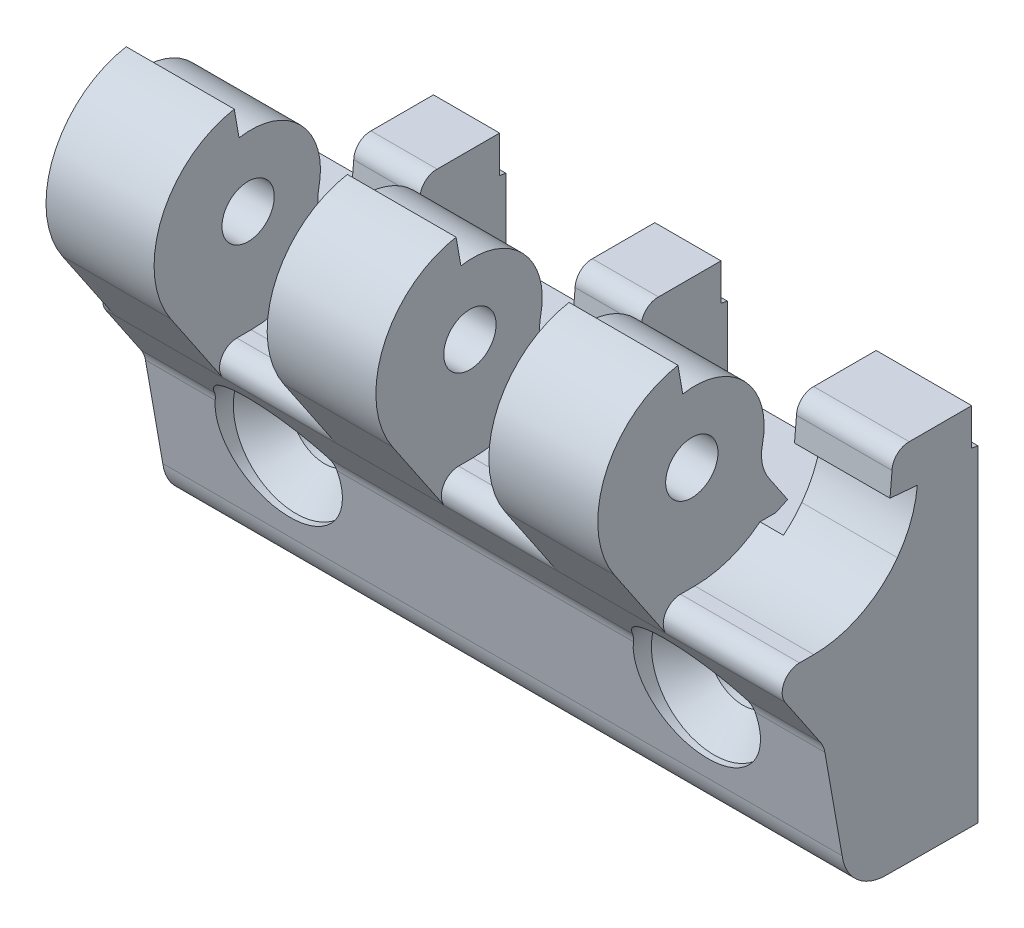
ISO-10303-21;
HEADER;
FILE_DESCRIPTION(('STEP AP214'),'2;1');
FILE_NAME('part.step','',(''),(''),'','','');
FILE_SCHEMA(('AUTOMOTIVE_DESIGN { 1 0 10303 214 1 1 1 1 }'));
ENDSEC;
DATA;
#1=APPLICATION_CONTEXT('core data for automotive mechanical design processes');
#2=APPLICATION_PROTOCOL_DEFINITION('international standard','automotive_design',2000,#1);
#3=PRODUCT_CONTEXT('',#1,'mechanical');
#4=PRODUCT('Part','Part','',(#3));
#5=PRODUCT_RELATED_PRODUCT_CATEGORY('part','',(#4));
#6=PRODUCT_DEFINITION_FORMATION('','',#4);
#7=PRODUCT_DEFINITION_CONTEXT('part definition',#1,'design');
#8=PRODUCT_DEFINITION('design','',#6,#7);
#9=PRODUCT_DEFINITION_SHAPE('','',#8);
#10=(LENGTH_UNIT() NAMED_UNIT(*) SI_UNIT(.MILLI.,.METRE.));
#11=(NAMED_UNIT(*) PLANE_ANGLE_UNIT() SI_UNIT($,.RADIAN.));
#12=(NAMED_UNIT(*) SI_UNIT($,.STERADIAN.) SOLID_ANGLE_UNIT());
#13=UNCERTAINTY_MEASURE_WITH_UNIT(LENGTH_MEASURE(1.E-05),#10,'distance_accuracy_value','');
#14=(GEOMETRIC_REPRESENTATION_CONTEXT(3) GLOBAL_UNCERTAINTY_ASSIGNED_CONTEXT((#13)) GLOBAL_UNIT_ASSIGNED_CONTEXT((#10,
#11,#12)) REPRESENTATION_CONTEXT('',''));
#15=CARTESIAN_POINT('',(0.,0.,0.));
#16=DIRECTION('',(0.,0.,1.));
#17=DIRECTION('',(1.,0.,0.));
#18=AXIS2_PLACEMENT_3D('',#15,#16,#17);
#19=CARTESIAN_POINT('',(-11.67,17.6979546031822,5.35403256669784));
#20=DIRECTION('',(-1.,0.,0.));
#21=DIRECTION('',(0.,-1.,0.));
#22=AXIS2_PLACEMENT_3D('',#19,#20,#21);
#23=CYLINDRICAL_SURFACE('',#22,3.97949973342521);
#24=DIRECTION('',(1.,0.,0.));
#25=VECTOR('',#24,1.);
#26=CARTESIAN_POINT('',(-11.67,15.4699793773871,8.65138673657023));
#27=LINE('',#26,#25);
#28=CARTESIAN_POINT('',(-11.67,15.4699794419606,8.65138678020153));
#29=VERTEX_POINT('',#28);
#30=CARTESIAN_POINT('',(-1.33,15.4699794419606,8.65138678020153));
#31=VERTEX_POINT('',#30);
#32=EDGE_CURVE('E485',#29,#31,#27,.T.);
#33=ORIENTED_EDGE('',*,*,#32,.F.);
#34=CARTESIAN_POINT('',(-11.67,17.6979546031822,5.35403256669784));
#35=DIRECTION('',(-1.,0.,0.));
#36=DIRECTION('',(0.,-1.,0.));
#37=AXIS2_PLACEMENT_3D('',#34,#35,#36);
#38=CIRCLE('',#37,3.97949973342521);
#39=CARTESIAN_POINT('',(-11.67,18.5614666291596,9.23871596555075));
#40=VERTEX_POINT('',#39);
#41=EDGE_CURVE('E471',#29,#40,#38,.T.);
#42=ORIENTED_EDGE('',*,*,#41,.T.);
#43=DIRECTION('',(-1.,0.,0.));
#44=VECTOR('',#43,1.);
#45=CARTESIAN_POINT('',(-11.67,18.5614666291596,9.23871596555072));
#46=LINE('',#45,#44);
#47=CARTESIAN_POINT('',(-1.33,18.5614666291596,9.23871596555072));
#48=VERTEX_POINT('',#47);
#49=EDGE_CURVE('E1085',#48,#40,#46,.T.);
#50=ORIENTED_EDGE('',*,*,#49,.F.);
#51=CARTESIAN_POINT('',(-1.33,17.6979546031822,5.35403256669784));
#52=DIRECTION('',(-1.,0.,0.));
#53=DIRECTION('',(0.,-1.,0.));
#54=AXIS2_PLACEMENT_3D('',#51,#52,#53);
#55=CIRCLE('',#54,3.97949973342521);
#56=EDGE_CURVE('E487',#31,#48,#55,.T.);
#57=ORIENTED_EDGE('',*,*,#56,.F.);
#58=EDGE_LOOP('',(#33,#42,#50,#57));
#59=FACE_BOUND('',#58,.T.);
#60=ADVANCED_FACE('F15',(#59),#23,.F.);
#61=CARTESIAN_POINT('',(-11.67,20.0002680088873,15.7132743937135));
#62=DIRECTION('',(-1.,0.,0.));
#63=DIRECTION('',(0.,-1.,0.));
#64=AXIS2_PLACEMENT_3D('',#61,#62,#63);
#65=CYLINDRICAL_SURFACE('',#64,6.6325);
#66=CARTESIAN_POINT('',(-11.67,20.0002680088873,15.7132743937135));
#67=DIRECTION('',(-1.,0.,0.));
#68=DIRECTION('',(0.,-1.,0.));
#69=AXIS2_PLACEMENT_3D('',#66,#67,#68);
#70=CIRCLE('',#69,6.6325);
#71=CARTESIAN_POINT('',(-11.67,26.5319666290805,16.8652159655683));
#72=VERTEX_POINT('',#71);
#73=EDGE_CURVE('E480',#40,#72,#70,.F.);
#74=ORIENTED_EDGE('',*,*,#73,.T.);
#75=DIRECTION('',(1.,0.,0.));
#76=VECTOR('',#75,1.);
#77=CARTESIAN_POINT('',(-11.67,26.5319666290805,16.8652159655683));
#78=LINE('',#77,#76);
#79=CARTESIAN_POINT('',(-1.33,26.5319666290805,16.8652159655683));
#80=VERTEX_POINT('',#79);
#81=EDGE_CURVE('E1082',#80,#72,#78,.F.);
#82=ORIENTED_EDGE('',*,*,#81,.F.);
#83=CARTESIAN_POINT('',(-1.33,20.0002680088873,15.7132743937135));
#84=DIRECTION('',(-1.,0.,0.));
#85=DIRECTION('',(0.,-1.,0.));
#86=AXIS2_PLACEMENT_3D('',#83,#84,#85);
#87=CIRCLE('',#86,6.6325);
#88=EDGE_CURVE('E713',#48,#80,#87,.F.);
#89=ORIENTED_EDGE('',*,*,#88,.F.);
#90=ORIENTED_EDGE('',*,*,#49,.T.);
#91=EDGE_LOOP('',(#74,#82,#89,#90));
#92=FACE_BOUND('',#91,.T.);
#93=ADVANCED_FACE('F1741',(#92),#65,.T.);
#94=CARTESIAN_POINT('',(-11.67,29.1444666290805,17.3262159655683));
#95=DIRECTION('',(0.,0.17377458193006,-0.98478545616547));
#96=DIRECTION('',(0.,0.98478545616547,0.17377458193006));
#97=AXIS2_PLACEMENT_3D('',#94,#95,#96);
#98=PLANE('',#97);
#99=DIRECTION('',(0.,0.98478545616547,0.173774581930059));
#100=VECTOR('',#99,1.);
#101=CARTESIAN_POINT('',(-11.67,26.5319666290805,16.8652159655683));
#102=LINE('',#101,#100);
#103=CARTESIAN_POINT('',(-11.67,29.1444666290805,17.3262159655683));
#104=VERTEX_POINT('',#103);
#105=EDGE_CURVE('E1461',#72,#104,#102,.T.);
#106=ORIENTED_EDGE('',*,*,#105,.T.);
#107=DIRECTION('',(-1.,0.,0.));
#108=VECTOR('',#107,1.);
#109=CARTESIAN_POINT('',(-11.67,29.1444666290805,17.3262159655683));
#110=LINE('',#109,#108);
#111=CARTESIAN_POINT('',(-1.33,29.1444666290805,17.3262159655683));
#112=VERTEX_POINT('',#111);
#113=EDGE_CURVE('E1078',#112,#104,#110,.T.);
#114=ORIENTED_EDGE('',*,*,#113,.F.);
#115=DIRECTION('',(0.,0.98478545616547,0.173774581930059));
#116=VECTOR('',#115,1.);
#117=CARTESIAN_POINT('',(-1.33,26.5319666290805,16.8652159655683));
#118=LINE('',#117,#116);
#119=EDGE_CURVE('E712',#80,#112,#118,.T.);
#120=ORIENTED_EDGE('',*,*,#119,.F.);
#121=ORIENTED_EDGE('',*,*,#81,.T.);
#122=EDGE_LOOP('',(#106,#114,#120,#121));
#123=FACE_BOUND('',#122,.T.);
#124=ADVANCED_FACE('F1743',(#123),#98,.T.);
#125=CARTESIAN_POINT('',(-11.67,20.0000000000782,15.7140000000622));
#126=DIRECTION('',(-1.,0.,0.));
#127=DIRECTION('',(0.,-1.,0.));
#128=AXIS2_PLACEMENT_3D('',#125,#126,#127);
#129=CYLINDRICAL_SURFACE('',#128,9.28549999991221);
#130=CARTESIAN_POINT('',(-11.67,20.0000000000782,15.7140000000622));
#131=DIRECTION('',(-1.,0.,0.));
#132=DIRECTION('',(0.,-1.,0.));
#133=AXIS2_PLACEMENT_3D('',#130,#131,#132);
#134=CIRCLE('',#133,9.28549999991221);
#135=CARTESIAN_POINT('',(-11.67,14.8019985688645,23.4082375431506));
#136=VERTEX_POINT('',#135);
#137=EDGE_CURVE('E1460',#104,#136,#134,.F.);
#138=ORIENTED_EDGE('',*,*,#137,.T.);
#139=DIRECTION('',(1.,0.,0.));
#140=VECTOR('',#139,1.);
#141=CARTESIAN_POINT('',(-11.67,14.8019985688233,23.4082375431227));
#142=LINE('',#141,#140);
#143=CARTESIAN_POINT('',(-1.33,14.8019985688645,23.4082375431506));
#144=VERTEX_POINT('',#143);
#145=EDGE_CURVE('E1074',#144,#136,#142,.F.);
#146=ORIENTED_EDGE('',*,*,#145,.F.);
#147=CARTESIAN_POINT('',(-1.33,20.0000000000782,15.7140000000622));
#148=DIRECTION('',(-1.,0.,0.));
#149=DIRECTION('',(0.,-1.,0.));
#150=AXIS2_PLACEMENT_3D('',#147,#148,#149);
#151=CIRCLE('',#150,9.28549999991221);
#152=EDGE_CURVE('E708',#112,#144,#151,.F.);
#153=ORIENTED_EDGE('',*,*,#152,.F.);
#154=ORIENTED_EDGE('',*,*,#113,.T.);
#155=EDGE_LOOP('',(#138,#146,#153,#154));
#156=FACE_BOUND('',#155,.T.);
#157=ADVANCED_FACE('F1746',(#156),#129,.T.);
#158=CARTESIAN_POINT('',(19.89,17.6979546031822,5.35403256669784));
#159=DIRECTION('',(1.,0.,0.));
#160=DIRECTION('',(0.,1.,0.));
#161=AXIS2_PLACEMENT_3D('',#158,#159,#160);
#162=CYLINDRICAL_SURFACE('',#161,3.97949973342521);
#163=DIRECTION('',(1.,0.,0.));
#164=VECTOR('',#163,1.);
#165=CARTESIAN_POINT('',(19.89,18.5614666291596,9.23871596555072));
#166=LINE('',#165,#164);
#167=CARTESIAN_POINT('',(19.89,18.5614666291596,9.23871596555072));
#168=VERTEX_POINT('',#167);
#169=CARTESIAN_POINT('',(9.49,18.5614666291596,9.23871596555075));
#170=VERTEX_POINT('',#169);
#171=EDGE_CURVE('E1081',#168,#170,#166,.F.);
#172=ORIENTED_EDGE('',*,*,#171,.F.);
#173=CARTESIAN_POINT('',(19.89,17.6979546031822,5.35403256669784));
#174=DIRECTION('',(1.,0.,0.));
#175=DIRECTION('',(0.,1.,0.));
#176=AXIS2_PLACEMENT_3D('',#173,#174,#175);
#177=CIRCLE('',#176,3.97949973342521);
#178=CARTESIAN_POINT('',(19.89,15.4699794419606,8.65138678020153));
#179=VERTEX_POINT('',#178);
#180=EDGE_CURVE('E695',#179,#168,#177,.F.);
#181=ORIENTED_EDGE('',*,*,#180,.F.);
#182=DIRECTION('',(1.,0.,0.));
#183=VECTOR('',#182,1.);
#184=CARTESIAN_POINT('',(19.89,15.4699793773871,8.65138673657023));
#185=LINE('',#184,#183);
#186=CARTESIAN_POINT('',(9.49,15.4699794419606,8.65138678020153));
#187=VERTEX_POINT('',#186);
#188=EDGE_CURVE('E490',#187,#179,#185,.T.);
#189=ORIENTED_EDGE('',*,*,#188,.F.);
#190=CARTESIAN_POINT('',(9.49,17.6979546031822,5.35403256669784));
#191=DIRECTION('',(1.,0.,0.));
#192=DIRECTION('',(0.,1.,0.));
#193=AXIS2_PLACEMENT_3D('',#190,#191,#192);
#194=CIRCLE('',#193,3.97949973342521);
#195=EDGE_CURVE('E724',#187,#170,#194,.F.);
#196=ORIENTED_EDGE('',*,*,#195,.T.);
#197=EDGE_LOOP('',(#172,#181,#189,#196));
#198=FACE_BOUND('',#197,.T.);
#199=ADVANCED_FACE('F1523',(#198),#162,.F.);
#200=CARTESIAN_POINT('',(19.89,20.0002680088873,15.7132743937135));
#201=DIRECTION('',(1.,0.,0.));
#202=DIRECTION('',(0.,1.,0.));
#203=AXIS2_PLACEMENT_3D('',#200,#201,#202);
#204=CYLINDRICAL_SURFACE('',#203,6.6325);
#205=CARTESIAN_POINT('',(19.89,20.0002680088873,15.7132743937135));
#206=DIRECTION('',(1.,0.,0.));
#207=DIRECTION('',(0.,1.,0.));
#208=AXIS2_PLACEMENT_3D('',#205,#206,#207);
#209=CIRCLE('',#208,6.6325);
#210=CARTESIAN_POINT('',(19.89,26.5319666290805,16.8652159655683));
#211=VERTEX_POINT('',#210);
#212=EDGE_CURVE('E692',#168,#211,#209,.T.);
#213=ORIENTED_EDGE('',*,*,#212,.F.);
#214=ORIENTED_EDGE('',*,*,#171,.T.);
#215=CARTESIAN_POINT('',(9.49,20.0002680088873,15.7132743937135));
#216=DIRECTION('',(1.,0.,0.));
#217=DIRECTION('',(0.,1.,0.));
#218=AXIS2_PLACEMENT_3D('',#215,#216,#217);
#219=CIRCLE('',#218,6.6325);
#220=CARTESIAN_POINT('',(9.49,26.5319666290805,16.8652159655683));
#221=VERTEX_POINT('',#220);
#222=EDGE_CURVE('E722',#170,#221,#219,.T.);
#223=ORIENTED_EDGE('',*,*,#222,.T.);
#224=DIRECTION('',(1.,0.,0.));
#225=VECTOR('',#224,1.);
#226=CARTESIAN_POINT('',(19.89,26.5319666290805,16.8652159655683));
#227=LINE('',#226,#225);
#228=EDGE_CURVE('E1501',#211,#221,#227,.F.);
#229=ORIENTED_EDGE('',*,*,#228,.F.);
#230=EDGE_LOOP('',(#213,#214,#223,#229));
#231=FACE_BOUND('',#230,.T.);
#232=ADVANCED_FACE('F1509',(#231),#204,.T.);
#233=CARTESIAN_POINT('',(19.89,26.5319666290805,16.8652159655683));
#234=DIRECTION('',(0.,0.17377458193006,-0.98478545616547));
#235=DIRECTION('',(0.,0.98478545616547,0.17377458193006));
#236=AXIS2_PLACEMENT_3D('',#233,#234,#235);
#237=PLANE('',#236);
#238=DIRECTION('',(0.,0.98478545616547,0.173774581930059));
#239=VECTOR('',#238,1.);
#240=CARTESIAN_POINT('',(19.89,26.5319666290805,16.8652159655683));
#241=LINE('',#240,#239);
#242=CARTESIAN_POINT('',(19.89,29.1444666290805,17.3262159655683));
#243=VERTEX_POINT('',#242);
#244=EDGE_CURVE('E691',#211,#243,#241,.T.);
#245=ORIENTED_EDGE('',*,*,#244,.F.);
#246=ORIENTED_EDGE('',*,*,#228,.T.);
#247=DIRECTION('',(0.,0.98478545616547,0.173774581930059));
#248=VECTOR('',#247,1.);
#249=CARTESIAN_POINT('',(9.49,26.5319666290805,16.8652159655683));
#250=LINE('',#249,#248);
#251=CARTESIAN_POINT('',(9.49,29.1444666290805,17.3262159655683));
#252=VERTEX_POINT('',#251);
#253=EDGE_CURVE('E721',#221,#252,#250,.T.);
#254=ORIENTED_EDGE('',*,*,#253,.T.);
#255=DIRECTION('',(1.,0.,0.));
#256=VECTOR('',#255,1.);
#257=CARTESIAN_POINT('',(19.89,29.1444666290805,17.3262159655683));
#258=LINE('',#257,#256);
#259=EDGE_CURVE('E1483',#243,#252,#258,.F.);
#260=ORIENTED_EDGE('',*,*,#259,.F.);
#261=EDGE_LOOP('',(#245,#246,#254,#260));
#262=FACE_BOUND('',#261,.T.);
#263=ADVANCED_FACE('F1518',(#262),#237,.T.);
#264=CARTESIAN_POINT('',(19.89,20.0000000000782,15.7140000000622));
#265=DIRECTION('',(1.,0.,0.));
#266=DIRECTION('',(0.,1.,0.));
#267=AXIS2_PLACEMENT_3D('',#264,#265,#266);
#268=CYLINDRICAL_SURFACE('',#267,9.28549999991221);
#269=CARTESIAN_POINT('',(19.89,20.0000000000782,15.7140000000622));
#270=DIRECTION('',(1.,0.,0.));
#271=DIRECTION('',(0.,1.,0.));
#272=AXIS2_PLACEMENT_3D('',#269,#270,#271);
#273=CIRCLE('',#272,9.28549999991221);
#274=CARTESIAN_POINT('',(19.89,14.8019985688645,23.4082375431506));
#275=VERTEX_POINT('',#274);
#276=EDGE_CURVE('E687',#243,#275,#273,.T.);
#277=ORIENTED_EDGE('',*,*,#276,.F.);
#278=ORIENTED_EDGE('',*,*,#259,.T.);
#279=CARTESIAN_POINT('',(9.49,20.0000000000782,15.7140000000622));
#280=DIRECTION('',(1.,0.,0.));
#281=DIRECTION('',(0.,1.,0.));
#282=AXIS2_PLACEMENT_3D('',#279,#280,#281);
#283=CIRCLE('',#282,9.28549999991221);
#284=CARTESIAN_POINT('',(9.49,14.8019985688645,23.4082375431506));
#285=VERTEX_POINT('',#284);
#286=EDGE_CURVE('E718',#252,#285,#283,.T.);
#287=ORIENTED_EDGE('',*,*,#286,.T.);
#288=DIRECTION('',(1.,0.,0.));
#289=VECTOR('',#288,1.);
#290=CARTESIAN_POINT('',(19.89,14.8019985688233,23.4082375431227));
#291=LINE('',#290,#289);
#292=EDGE_CURVE('E1474',#275,#285,#291,.F.);
#293=ORIENTED_EDGE('',*,*,#292,.F.);
#294=EDGE_LOOP('',(#277,#278,#287,#293));
#295=FACE_BOUND('',#294,.T.);
#296=ADVANCED_FACE('F1521',(#295),#268,.T.);
#297=CARTESIAN_POINT('',(41.12,17.6979546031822,5.35403256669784));
#298=DIRECTION('',(1.,0.,0.));
#299=DIRECTION('',(0.,1.,0.));
#300=AXIS2_PLACEMENT_3D('',#297,#298,#299);
#301=CYLINDRICAL_SURFACE('',#300,3.97949973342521);
#302=DIRECTION('',(1.,0.,0.));
#303=VECTOR('',#302,1.);
#304=CARTESIAN_POINT('',(41.12,18.5614666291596,9.23871596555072));
#305=LINE('',#304,#303);
#306=CARTESIAN_POINT('',(41.12,18.5614666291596,9.23871596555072));
#307=VERTEX_POINT('',#306);
#308=CARTESIAN_POINT('',(30.7,18.5614666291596,9.23871596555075));
#309=VERTEX_POINT('',#308);
#310=EDGE_CURVE('E1480',#307,#309,#305,.F.);
#311=ORIENTED_EDGE('',*,*,#310,.F.);
#312=CARTESIAN_POINT('',(41.12,17.6979546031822,5.35403256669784));
#313=DIRECTION('',(1.,0.,0.));
#314=DIRECTION('',(0.,1.,0.));
#315=AXIS2_PLACEMENT_3D('',#312,#313,#314);
#316=CIRCLE('',#315,3.97949973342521);
#317=CARTESIAN_POINT('',(41.12,15.4699794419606,8.65138678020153));
#318=VERTEX_POINT('',#317);
#319=EDGE_CURVE('E683',#318,#307,#316,.F.);
#320=ORIENTED_EDGE('',*,*,#319,.F.);
#321=DIRECTION('',(1.,0.,0.));
#322=VECTOR('',#321,1.);
#323=CARTESIAN_POINT('',(41.12,15.4699793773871,8.65138673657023));
#324=LINE('',#323,#322);
#325=CARTESIAN_POINT('',(30.7,15.4699794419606,8.65138678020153));
#326=VERTEX_POINT('',#325);
#327=EDGE_CURVE('E1418',#326,#318,#324,.T.);
#328=ORIENTED_EDGE('',*,*,#327,.F.);
#329=CARTESIAN_POINT('',(30.7,17.6979546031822,5.35403256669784));
#330=DIRECTION('',(1.,0.,0.));
#331=DIRECTION('',(0.,1.,0.));
#332=AXIS2_PLACEMENT_3D('',#329,#330,#331);
#333=CIRCLE('',#332,3.97949973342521);
#334=EDGE_CURVE('E705',#326,#309,#333,.F.);
#335=ORIENTED_EDGE('',*,*,#334,.T.);
#336=EDGE_LOOP('',(#311,#320,#328,#335));
#337=FACE_BOUND('',#336,.T.);
#338=ADVANCED_FACE('F1645',(#337),#301,.F.);
#339=CARTESIAN_POINT('',(41.12,20.0002680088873,15.7132743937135));
#340=DIRECTION('',(1.,0.,0.));
#341=DIRECTION('',(0.,1.,0.));
#342=AXIS2_PLACEMENT_3D('',#339,#340,#341);
#343=CYLINDRICAL_SURFACE('',#342,6.6325);
#344=CARTESIAN_POINT('',(41.12,20.0002680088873,15.7132743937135));
#345=DIRECTION('',(1.,0.,0.));
#346=DIRECTION('',(0.,1.,0.));
#347=AXIS2_PLACEMENT_3D('',#344,#345,#346);
#348=CIRCLE('',#347,6.6325);
#349=CARTESIAN_POINT('',(41.12,26.5319666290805,16.8652159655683));
#350=VERTEX_POINT('',#349);
#351=EDGE_CURVE('E680',#307,#350,#348,.T.);
#352=ORIENTED_EDGE('',*,*,#351,.F.);
#353=ORIENTED_EDGE('',*,*,#310,.T.);
#354=CARTESIAN_POINT('',(30.7,20.0002680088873,15.7132743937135));
#355=DIRECTION('',(1.,0.,0.));
#356=DIRECTION('',(0.,1.,0.));
#357=AXIS2_PLACEMENT_3D('',#354,#355,#356);
#358=CIRCLE('',#357,6.6325);
#359=CARTESIAN_POINT('',(30.7,26.5319666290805,16.8652159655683));
#360=VERTEX_POINT('',#359);
#361=EDGE_CURVE('E703',#309,#360,#358,.T.);
#362=ORIENTED_EDGE('',*,*,#361,.T.);
#363=DIRECTION('',(1.,0.,0.));
#364=VECTOR('',#363,1.);
#365=CARTESIAN_POINT('',(41.12,26.5319666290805,16.8652159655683));
#366=LINE('',#365,#364);
#367=EDGE_CURVE('E1477',#350,#360,#366,.F.);
#368=ORIENTED_EDGE('',*,*,#367,.F.);
#369=EDGE_LOOP('',(#352,#353,#362,#368));
#370=FACE_BOUND('',#369,.T.);
#371=ADVANCED_FACE('F1648',(#370),#343,.T.);
#372=CARTESIAN_POINT('',(41.12,26.5319666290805,16.8652159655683));
#373=DIRECTION('',(0.,0.17377458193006,-0.98478545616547));
#374=DIRECTION('',(0.,0.98478545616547,0.17377458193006));
#375=AXIS2_PLACEMENT_3D('',#372,#373,#374);
#376=PLANE('',#375);
#377=DIRECTION('',(0.,0.98478545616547,0.173774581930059));
#378=VECTOR('',#377,1.);
#379=CARTESIAN_POINT('',(41.12,26.5319666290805,16.8652159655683));
#380=LINE('',#379,#378);
#381=CARTESIAN_POINT('',(41.12,29.1444666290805,17.3262159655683));
#382=VERTEX_POINT('',#381);
#383=EDGE_CURVE('E679',#350,#382,#380,.T.);
#384=ORIENTED_EDGE('',*,*,#383,.F.);
#385=ORIENTED_EDGE('',*,*,#367,.T.);
#386=DIRECTION('',(0.,0.98478545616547,0.173774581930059));
#387=VECTOR('',#386,1.);
#388=CARTESIAN_POINT('',(30.7,26.5319666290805,16.8652159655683));
#389=LINE('',#388,#387);
#390=CARTESIAN_POINT('',(30.7,29.1444666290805,17.3262159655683));
#391=VERTEX_POINT('',#390);
#392=EDGE_CURVE('E702',#360,#391,#389,.T.);
#393=ORIENTED_EDGE('',*,*,#392,.T.);
#394=DIRECTION('',(1.,0.,0.));
#395=VECTOR('',#394,1.);
#396=CARTESIAN_POINT('',(41.12,29.1444666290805,17.3262159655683));
#397=LINE('',#396,#395);
#398=EDGE_CURVE('E1077',#382,#391,#397,.F.);
#399=ORIENTED_EDGE('',*,*,#398,.F.);
#400=EDGE_LOOP('',(#384,#385,#393,#399));
#401=FACE_BOUND('',#400,.T.);
#402=ADVANCED_FACE('F1651',(#401),#376,.T.);
#403=CARTESIAN_POINT('',(41.12,20.0000000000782,15.7140000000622));
#404=DIRECTION('',(1.,0.,0.));
#405=DIRECTION('',(0.,1.,0.));
#406=AXIS2_PLACEMENT_3D('',#403,#404,#405);
#407=CYLINDRICAL_SURFACE('',#406,9.28549999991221);
#408=CARTESIAN_POINT('',(41.12,20.0000000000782,15.7140000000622));
#409=DIRECTION('',(1.,0.,0.));
#410=DIRECTION('',(0.,1.,0.));
#411=AXIS2_PLACEMENT_3D('',#408,#409,#410);
#412=CIRCLE('',#411,9.28549999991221);
#413=CARTESIAN_POINT('',(41.12,14.8019985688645,23.4082375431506));
#414=VERTEX_POINT('',#413);
#415=EDGE_CURVE('E675',#382,#414,#412,.T.);
#416=ORIENTED_EDGE('',*,*,#415,.F.);
#417=ORIENTED_EDGE('',*,*,#398,.T.);
#418=CARTESIAN_POINT('',(30.7,20.0000000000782,15.7140000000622));
#419=DIRECTION('',(1.,0.,0.));
#420=DIRECTION('',(0.,1.,0.));
#421=AXIS2_PLACEMENT_3D('',#418,#419,#420);
#422=CIRCLE('',#421,9.28549999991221);
#423=CARTESIAN_POINT('',(30.7,14.8019985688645,23.4082375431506));
#424=VERTEX_POINT('',#423);
#425=EDGE_CURVE('E699',#391,#424,#422,.T.);
#426=ORIENTED_EDGE('',*,*,#425,.T.);
#427=DIRECTION('',(1.,0.,0.));
#428=VECTOR('',#427,1.);
#429=CARTESIAN_POINT('',(41.12,14.8019985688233,23.4082375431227));
#430=LINE('',#429,#428);
#431=EDGE_CURVE('E1459',#414,#424,#430,.F.);
#432=ORIENTED_EDGE('',*,*,#431,.F.);
#433=EDGE_LOOP('',(#416,#417,#426,#432));
#434=FACE_BOUND('',#433,.T.);
#435=ADVANCED_FACE('F1622',(#434),#407,.T.);
#436=CARTESIAN_POINT('',(-11.67,7.4644666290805,18.4512159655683));
#437=DIRECTION('',(0.,-0.559797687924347,0.828629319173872));
#438=DIRECTION('',(0.,-0.828629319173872,-0.559797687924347));
#439=AXIS2_PLACEMENT_3D('',#436,#437,#438);
#440=PLANE('',#439);
#441=ORIENTED_EDGE('',*,*,#145,.T.);
#442=DIRECTION('',(0.,-0.82862931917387,-0.559797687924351));
#443=VECTOR('',#442,1.);
#444=CARTESIAN_POINT('',(-11.67,14.8019985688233,23.4082375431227));
#445=LINE('',#444,#443);
#446=CARTESIAN_POINT('',(-11.67,7.48718669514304,18.4665649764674));
#447=VERTEX_POINT('',#446);
#448=EDGE_CURVE('E1457',#136,#447,#445,.T.);
#449=ORIENTED_EDGE('',*,*,#448,.T.);
#450=DIRECTION('',(1.,0.,0.));
#451=VECTOR('',#450,1.);
#452=CARTESIAN_POINT('',(52.5,7.4871866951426,18.4665649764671));
#453=LINE('',#452,#451);
#454=CARTESIAN_POINT('',(-1.33,7.48718669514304,18.4665649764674));
#455=VERTEX_POINT('',#454);
#456=EDGE_CURVE('E666',#455,#447,#453,.F.);
#457=ORIENTED_EDGE('',*,*,#456,.F.);
#458=DIRECTION('',(0.,-0.82862931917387,-0.559797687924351));
#459=VECTOR('',#458,1.);
#460=CARTESIAN_POINT('',(-1.33,14.8019985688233,23.4082375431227));
#461=LINE('',#460,#459);
#462=EDGE_CURVE('E711',#144,#455,#461,.T.);
#463=ORIENTED_EDGE('',*,*,#462,.F.);
#464=EDGE_LOOP('',(#441,#449,#457,#463));
#465=FACE_BOUND('',#464,.T.);
#466=ADVANCED_FACE('F1667',(#465),#440,.T.);
#467=CARTESIAN_POINT('',(-11.67,20.,0.));
#468=DIRECTION('',(1.,0.,0.));
#469=DIRECTION('',(0.,1.,0.));
#470=AXIS2_PLACEMENT_3D('',#467,#468,#469);
#471=PLANE('',#470);
#472=CARTESIAN_POINT('',(-11.67,20.,16.));
#473=DIRECTION('',(-1.,0.,0.));
#474=DIRECTION('',(0.,0.,1.));
#475=AXIS2_PLACEMENT_3D('',#472,#473,#474);
#476=CIRCLE('',#475,2.5);
#477=CARTESIAN_POINT('',(-11.67,20.,18.5));
#478=VERTEX_POINT('',#477);
#479=EDGE_CURVE('E1608',#478,#478,#476,.T.);
#480=ORIENTED_EDGE('',*,*,#479,.F.);
#481=EDGE_LOOP('',(#480));
#482=FACE_BOUND('',#481,.T.);
#483=ORIENTED_EDGE('',*,*,#448,.F.);
#484=ORIENTED_EDGE('',*,*,#137,.F.);
#485=ORIENTED_EDGE('',*,*,#105,.F.);
#486=ORIENTED_EDGE('',*,*,#73,.F.);
#487=ORIENTED_EDGE('',*,*,#41,.F.);
#488=DIRECTION('',(0.,0.828585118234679,0.55986310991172));
#489=VECTOR('',#488,1.);
#490=CARTESIAN_POINT('',(-11.67,15.4699793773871,8.65138673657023));
#491=LINE('',#490,#489);
#492=CARTESIAN_POINT('',(-11.67,12.7724666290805,6.82871596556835));
#493=VERTEX_POINT('',#492);
#494=EDGE_CURVE('E477',#493,#29,#491,.T.);
#495=ORIENTED_EDGE('',*,*,#494,.F.);
#496=DIRECTION('',(0.,0.415426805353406,-0.909626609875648));
#497=VECTOR('',#496,1.);
#498=CARTESIAN_POINT('',(-11.67,12.25,7.97271905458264));
#499=LINE('',#498,#497);
#500=CARTESIAN_POINT('',(-11.67,12.25,7.97271905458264));
#501=VERTEX_POINT('',#500);
#502=EDGE_CURVE('E483',#501,#493,#499,.T.);
#503=ORIENTED_EDGE('',*,*,#502,.F.);
#504=DIRECTION('',(0.,0.,1.));
#505=VECTOR('',#504,1.);
#506=CARTESIAN_POINT('',(-11.67,12.25,0.));
#507=LINE('',#506,#505);
#508=CARTESIAN_POINT('',(-11.67,12.25,9.47537381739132));
#509=VERTEX_POINT('',#508);
#510=EDGE_CURVE('E506',#509,#501,#507,.F.);
#511=ORIENTED_EDGE('',*,*,#510,.F.);
#512=CARTESIAN_POINT('',(-11.67,19.9999999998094,15.7139714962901));
#513=DIRECTION('',(1.,0.,0.));
#514=DIRECTION('',(0.,1.,0.));
#515=AXIS2_PLACEMENT_3D('',#512,#513,#514);
#516=CIRCLE('',#515,9.94899999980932);
#517=CARTESIAN_POINT('',(-11.67,10.051,15.7139714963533));
#518=VERTEX_POINT('',#517);
#519=EDGE_CURVE('E671',#509,#518,#516,.F.);
#520=ORIENTED_EDGE('',*,*,#519,.T.);
#521=DIRECTION('',(0.,0.,1.));
#522=VECTOR('',#521,1.);
#523=CARTESIAN_POINT('',(-11.67,10.051,15.7139714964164));
#524=LINE('',#523,#522);
#525=CARTESIAN_POINT('',(-11.67,10.051,17.0778728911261));
#526=VERTEX_POINT('',#525);
#527=EDGE_CURVE('E673',#526,#518,#524,.F.);
#528=ORIENTED_EDGE('',*,*,#527,.F.);
#529=CARTESIAN_POINT('',(-11.67,8.3930001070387,17.0778728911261));
#530=DIRECTION('',(1.,0.,0.));
#531=DIRECTION('',(0.,1.,0.));
#532=AXIS2_PLACEMENT_3D('',#529,#530,#531);
#533=CIRCLE('',#532,1.65799989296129);
#534=EDGE_CURVE('E662',#447,#526,#533,.F.);
#535=ORIENTED_EDGE('',*,*,#534,.F.);
#536=EDGE_LOOP('',(#483,#484,#485,#486,#487,#495,#503,#511,#520,#528,#535));
#537=FACE_BOUND('',#536,.T.);
#538=ADVANCED_FACE('F474',(#482,#537),#471,.F.);
#539=CARTESIAN_POINT('',(41.12,14.8019985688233,23.4082375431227));
#540=DIRECTION('',(0.,-0.559797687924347,0.828629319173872));
#541=DIRECTION('',(0.,-0.828629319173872,-0.559797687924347));
#542=AXIS2_PLACEMENT_3D('',#539,#540,#541);
#543=PLANE('',#542);
#544=ORIENTED_EDGE('',*,*,#431,.T.);
#545=DIRECTION('',(0.,-0.82862931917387,-0.559797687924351));
#546=VECTOR('',#545,1.);
#547=CARTESIAN_POINT('',(30.7,14.8019985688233,23.4082375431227));
#548=LINE('',#547,#546);
#549=CARTESIAN_POINT('',(30.7,7.48718669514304,18.4665649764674));
#550=VERTEX_POINT('',#549);
#551=EDGE_CURVE('E701',#424,#550,#548,.T.);
#552=ORIENTED_EDGE('',*,*,#551,.T.);
#553=DIRECTION('',(1.,0.,0.));
#554=VECTOR('',#553,1.);
#555=CARTESIAN_POINT('',(52.5,7.4871866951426,18.4665649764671));
#556=LINE('',#555,#554);
#557=CARTESIAN_POINT('',(41.12,7.48718669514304,18.4665649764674));
#558=VERTEX_POINT('',#557);
#559=EDGE_CURVE('E657',#558,#550,#556,.F.);
#560=ORIENTED_EDGE('',*,*,#559,.F.);
#561=DIRECTION('',(0.,-0.82862931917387,-0.559797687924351));
#562=VECTOR('',#561,1.);
#563=CARTESIAN_POINT('',(41.12,14.8019985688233,23.4082375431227));
#564=LINE('',#563,#562);
#565=EDGE_CURVE('E678',#414,#558,#564,.T.);
#566=ORIENTED_EDGE('',*,*,#565,.F.);
#567=EDGE_LOOP('',(#544,#552,#560,#566));
#568=FACE_BOUND('',#567,.T.);
#569=ADVANCED_FACE('F1626',(#568),#543,.T.);
#570=CARTESIAN_POINT('',(19.89,14.8019985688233,23.4082375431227));
#571=DIRECTION('',(0.,-0.559797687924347,0.828629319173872));
#572=DIRECTION('',(0.,-0.828629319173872,-0.559797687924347));
#573=AXIS2_PLACEMENT_3D('',#570,#571,#572);
#574=PLANE('',#573);
#575=ORIENTED_EDGE('',*,*,#292,.T.);
#576=DIRECTION('',(0.,-0.82862931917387,-0.559797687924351));
#577=VECTOR('',#576,1.);
#578=CARTESIAN_POINT('',(9.49,14.8019985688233,23.4082375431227));
#579=LINE('',#578,#577);
#580=CARTESIAN_POINT('',(9.49,7.48718669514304,18.4665649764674));
#581=VERTEX_POINT('',#580);
#582=EDGE_CURVE('E720',#285,#581,#579,.T.);
#583=ORIENTED_EDGE('',*,*,#582,.T.);
#584=DIRECTION('',(1.,0.,0.));
#585=VECTOR('',#584,1.);
#586=CARTESIAN_POINT('',(52.5,7.4871866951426,18.4665649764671));
#587=LINE('',#586,#585);
#588=CARTESIAN_POINT('',(19.89,7.48718669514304,18.4665649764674));
#589=VERTEX_POINT('',#588);
#590=EDGE_CURVE('E649',#589,#581,#587,.F.);
#591=ORIENTED_EDGE('',*,*,#590,.F.);
#592=DIRECTION('',(0.,-0.82862931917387,-0.559797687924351));
#593=VECTOR('',#592,1.);
#594=CARTESIAN_POINT('',(19.89,14.8019985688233,23.4082375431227));
#595=LINE('',#594,#593);
#596=EDGE_CURVE('E690',#275,#589,#595,.T.);
#597=ORIENTED_EDGE('',*,*,#596,.F.);
#598=EDGE_LOOP('',(#575,#583,#591,#597));
#599=FACE_BOUND('',#598,.T.);
#600=ADVANCED_FACE('F786',(#599),#574,.T.);
#601=CARTESIAN_POINT('',(0.,0.,15.375));
#602=DIRECTION('',(0.,0.,1.));
#603=DIRECTION('',(1.,0.,0.));
#604=AXIS2_PLACEMENT_3D('',#601,#602,#603);
#605=CYLINDRICAL_SURFACE('',#604,6.);
#606=CARTESIAN_POINT('',(0.,0.,12.7500000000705));
#607=DIRECTION('',(0.,0.,1.));
#608=DIRECTION('',(1.,0.,0.));
#609=AXIS2_PLACEMENT_3D('',#606,#607,#608);
#610=CIRCLE('',#609,5.99999999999);
#611=CARTESIAN_POINT('',(5.99999999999,0.,12.7500000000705));
#612=VERTEX_POINT('',#611);
#613=EDGE_CURVE('E1379',#612,#612,#610,.F.);
#614=ORIENTED_EDGE('',*,*,#613,.T.);
#615=EDGE_LOOP('',(#614));
#616=FACE_BOUND('',#615,.T.);
#617=CARTESIAN_POINT('',(-5.47425537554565,2.45612053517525,15.0682436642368));
#618=CARTESIAN_POINT('',(-5.50187338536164,2.39458391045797,15.0266729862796));
#619=CARTESIAN_POINT('',(-5.52907581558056,2.33115803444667,14.9875921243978));
#620=CARTESIAN_POINT('',(-5.58225584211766,2.20076305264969,14.9146691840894));
#621=CARTESIAN_POINT('',(-5.60823191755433,2.13378975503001,14.8808334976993));
#622=CARTESIAN_POINT('',(-5.65804752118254,1.9979107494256,14.8193167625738));
#623=CARTESIAN_POINT('',(-5.68191693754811,1.92906097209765,14.7915365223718));
#624=CARTESIAN_POINT('',(-5.72764205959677,1.78872916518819,14.741703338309));
#625=CARTESIAN_POINT('',(-5.74949953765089,1.71724953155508,14.7196453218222));
#626=CARTESIAN_POINT('',(-5.78014429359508,1.60973716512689,14.6914217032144));
#627=CARTESIAN_POINT('',(-5.78983000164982,1.57455104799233,14.6829476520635));
#628=CARTESIAN_POINT('',(-5.80867071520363,1.50356219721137,14.6673862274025));
#629=CARTESIAN_POINT('',(-5.81782323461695,1.4677574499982,14.6603050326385));
#630=CARTESIAN_POINT('',(-5.8266723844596,1.4317433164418,14.6539547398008));
#631=B_SPLINE_CURVE_WITH_KNOTS('',3,(#617,#618,#619,#620,#621,#622,#623,#624,#625,#626,#627,
#628,#629,#630),.UNSPECIFIED.,.F.,.F.,(4,2,2,2,2,2,4),(0.,0.237657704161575,0.475602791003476,
0.709295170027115,0.942779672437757,1.05514762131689,1.1680033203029),.UNSPECIFIED.);
#632=CARTESIAN_POINT('',(-5.47425537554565,2.4561205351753,15.0682436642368));
#633=VERTEX_POINT('',#632);
#634=CARTESIAN_POINT('',(-5.8266723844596,1.4317433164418,14.6539547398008));
#635=VERTEX_POINT('',#634);
#636=EDGE_CURVE('E766',#633,#635,#631,.T.);
#637=ORIENTED_EDGE('',*,*,#636,.T.);
#638=CARTESIAN_POINT('',(0.,0.,14.4014999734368));
#639=DIRECTION('',(0.,-0.173648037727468,0.984807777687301));
#640=DIRECTION('',(0.,0.984807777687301,0.173648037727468));
#641=AXIS2_PLACEMENT_3D('',#638,#639,#640);
#642=ELLIPSE('',#641,6.09255951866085,6.);
#643=CARTESIAN_POINT('',(5.8266723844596,1.4317433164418,14.6539547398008));
#644=VERTEX_POINT('',#643);
#645=EDGE_CURVE('E633',#644,#635,#642,.F.);
#646=ORIENTED_EDGE('',*,*,#645,.F.);
#647=CARTESIAN_POINT('',(5.8266723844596,1.4317433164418,14.6539547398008));
#648=CARTESIAN_POINT('',(5.80803772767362,1.50763149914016,14.6673286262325));
#649=CARTESIAN_POINT('',(5.78803540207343,1.5825865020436,14.683960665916));
#650=CARTESIAN_POINT('',(5.745644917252,1.73014927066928,14.7234222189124));
#651=CARTESIAN_POINT('',(5.72325699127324,1.80275726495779,14.7462511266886));
#652=CARTESIAN_POINT('',(5.67682992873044,1.94397722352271,14.797362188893));
#653=CARTESIAN_POINT('',(5.65282440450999,2.01263553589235,14.8255474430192));
#654=CARTESIAN_POINT('',(5.60322371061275,2.1468573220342,14.8872905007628));
#655=CARTESIAN_POINT('',(5.57762927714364,2.21242220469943,14.9208458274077));
#656=CARTESIAN_POINT('',(5.53884912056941,2.30700115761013,14.9742923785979));
#657=CARTESIAN_POINT('',(5.52611874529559,2.33732152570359,14.9922347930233));
#658=CARTESIAN_POINT('',(5.50037581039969,2.39727643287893,15.0293414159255));
#659=CARTESIAN_POINT('',(5.48736231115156,2.42690766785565,15.0485103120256));
#660=CARTESIAN_POINT('',(5.47425537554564,2.4561205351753,15.0682436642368));
#661=B_SPLINE_CURVE_WITH_KNOTS('',3,(#647,#648,#649,#650,#651,#652,#653,#654,#655,#656,#657,
#658,#659,#660),.UNSPECIFIED.,.F.,.F.,(4,2,2,2,2,2,4),(0.,0.237721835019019,0.475420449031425,
0.709169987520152,0.942812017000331,1.05517194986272,1.1679904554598),.UNSPECIFIED.);
#662=CARTESIAN_POINT('',(5.47425537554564,2.4561205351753,15.0682436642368));
#663=VERTEX_POINT('',#662);
#664=EDGE_CURVE('E495',#644,#663,#661,.T.);
#665=ORIENTED_EDGE('',*,*,#664,.T.);
#666=CARTESIAN_POINT('',(0.,0.,13.4090871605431));
#667=DIRECTION('',(0.,-0.559768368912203,0.828649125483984));
#668=DIRECTION('',(0.,0.828649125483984,0.559768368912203));
#669=AXIS2_PLACEMENT_3D('',#666,#667,#668);
#670=ELLIPSE('',#669,7.24070033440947,6.);
#671=EDGE_CURVE('E642',#633,#663,#670,.F.);
#672=ORIENTED_EDGE('',*,*,#671,.F.);
#673=EDGE_LOOP('',(#637,#646,#665,#672));
#674=FACE_BOUND('',#673,.T.);
#675=ADVANCED_FACE('F739',(#616,#674),#605,.F.);
#676=CARTESIAN_POINT('',(52.5,0.971055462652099,17.2666486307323));
#677=DIRECTION('',(1.,0.,0.));
#678=DIRECTION('',(0.,1.,0.));
#679=AXIS2_PLACEMENT_3D('',#676,#677,#678);
#680=CYLINDRICAL_SURFACE('',#679,2.65299880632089);
#681=DIRECTION('',(1.,0.,0.));
#682=VECTOR('',#681,1.);
#683=CARTESIAN_POINT('',(52.5,2.4561205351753,15.0682436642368));
#684=LINE('',#683,#682);
#685=CARTESIAN_POINT('',(-12.5,2.45612040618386,15.0682435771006));
#686=VERTEX_POINT('',#685);
#687=EDGE_CURVE('E636',#686,#633,#684,.T.);
#688=ORIENTED_EDGE('',*,*,#687,.F.);
#689=CARTESIAN_POINT('',(-12.5,0.971055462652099,17.2666486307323));
#690=DIRECTION('',(1.,0.,0.));
#691=DIRECTION('',(0.,1.,0.));
#692=AXIS2_PLACEMENT_3D('',#689,#690,#691);
#693=CIRCLE('',#692,2.65299880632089);
#694=CARTESIAN_POINT('',(-12.5,1.4317434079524,14.6539547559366));
#695=VERTEX_POINT('',#694);
#696=EDGE_CURVE('E773',#695,#686,#693,.T.);
#697=ORIENTED_EDGE('',*,*,#696,.F.);
#698=DIRECTION('',(1.,0.,0.));
#699=VECTOR('',#698,1.);
#700=CARTESIAN_POINT('',(52.5,1.4317433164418,14.6539547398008));
#701=LINE('',#700,#699);
#702=EDGE_CURVE('E635',#635,#695,#701,.F.);
#703=ORIENTED_EDGE('',*,*,#702,.F.);
#704=ORIENTED_EDGE('',*,*,#636,.F.);
#705=EDGE_LOOP('',(#688,#697,#703,#704));
#706=FACE_BOUND('',#705,.T.);
#707=ADVANCED_FACE('F775',(#706),#680,.F.);
#708=CARTESIAN_POINT('',(52.5,0.971055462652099,17.2666486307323));
#709=DIRECTION('',(1.,0.,0.));
#710=DIRECTION('',(0.,1.,0.));
#711=AXIS2_PLACEMENT_3D('',#708,#709,#710);
#712=CYLINDRICAL_SURFACE('',#711,2.65299880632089);
#713=DIRECTION('',(1.,0.,0.));
#714=VECTOR('',#713,1.);
#715=CARTESIAN_POINT('',(52.5,1.4317433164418,14.6539547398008));
#716=LINE('',#715,#714);
#717=CARTESIAN_POINT('',(52.5,1.4317434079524,14.6539547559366));
#718=VERTEX_POINT('',#717);
#719=CARTESIAN_POINT('',(45.8266723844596,1.4317433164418,14.6539547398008));
#720=VERTEX_POINT('',#719);
#721=EDGE_CURVE('E632',#718,#720,#716,.F.);
#722=ORIENTED_EDGE('',*,*,#721,.F.);
#723=CARTESIAN_POINT('',(52.5,0.971055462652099,17.2666486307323));
#724=DIRECTION('',(1.,0.,0.));
#725=DIRECTION('',(0.,1.,0.));
#726=AXIS2_PLACEMENT_3D('',#723,#724,#725);
#727=CIRCLE('',#726,2.65299880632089);
#728=CARTESIAN_POINT('',(52.5,2.45612040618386,15.0682435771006));
#729=VERTEX_POINT('',#728);
#730=EDGE_CURVE('E764',#729,#718,#727,.F.);
#731=ORIENTED_EDGE('',*,*,#730,.F.);
#732=DIRECTION('',(1.,0.,0.));
#733=VECTOR('',#732,1.);
#734=CARTESIAN_POINT('',(52.5,2.4561205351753,15.0682436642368));
#735=LINE('',#734,#733);
#736=CARTESIAN_POINT('',(45.4742553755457,2.4561205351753,15.0682436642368));
#737=VERTEX_POINT('',#736);
#738=EDGE_CURVE('E640',#737,#729,#735,.T.);
#739=ORIENTED_EDGE('',*,*,#738,.F.);
#740=CARTESIAN_POINT('',(45.8266723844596,1.4317433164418,14.6539547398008));
#741=CARTESIAN_POINT('',(45.8080377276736,1.50763149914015,14.6673286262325));
#742=CARTESIAN_POINT('',(45.7880354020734,1.5825865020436,14.683960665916));
#743=CARTESIAN_POINT('',(45.745644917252,1.73014927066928,14.7234222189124));
#744=CARTESIAN_POINT('',(45.7232569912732,1.80275726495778,14.7462511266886));
#745=CARTESIAN_POINT('',(45.6768299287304,1.94397722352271,14.797362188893));
#746=CARTESIAN_POINT('',(45.65282440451,2.01263553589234,14.8255474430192));
#747=CARTESIAN_POINT('',(45.6032237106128,2.1468573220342,14.8872905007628));
#748=CARTESIAN_POINT('',(45.5776292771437,2.21242220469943,14.9208458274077));
#749=CARTESIAN_POINT('',(45.5388491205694,2.30700115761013,14.9742923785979));
#750=CARTESIAN_POINT('',(45.5261187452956,2.33732152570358,14.9922347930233));
#751=CARTESIAN_POINT('',(45.5003758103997,2.39727643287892,15.0293414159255));
#752=CARTESIAN_POINT('',(45.4873623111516,2.42690766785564,15.0485103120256));
#753=CARTESIAN_POINT('',(45.4742553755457,2.4561205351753,15.0682436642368));
#754=B_SPLINE_CURVE_WITH_KNOTS('',3,(#740,#741,#742,#743,#744,#745,#746,#747,#748,#749,#750,
#751,#752,#753),.UNSPECIFIED.,.F.,.F.,(4,2,2,2,2,2,4),(0.,0.237721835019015,0.47542044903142,
0.709169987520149,0.942812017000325,1.0551719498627,1.16799045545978),.UNSPECIFIED.);
#755=EDGE_CURVE('E758',#720,#737,#754,.T.);
#756=ORIENTED_EDGE('',*,*,#755,.F.);
#757=EDGE_LOOP('',(#722,#731,#739,#756));
#758=FACE_BOUND('',#757,.T.);
#759=ADVANCED_FACE('F754',(#758),#712,.F.);
#760=CARTESIAN_POINT('',(40.,0.,15.375));
#761=DIRECTION('',(0.,0.,1.));
#762=DIRECTION('',(1.,0.,0.));
#763=AXIS2_PLACEMENT_3D('',#760,#761,#762);
#764=CYLINDRICAL_SURFACE('',#763,6.);
#765=CARTESIAN_POINT('',(40.,0.,12.7500000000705));
#766=DIRECTION('',(0.,0.,1.));
#767=DIRECTION('',(1.,0.,0.));
#768=AXIS2_PLACEMENT_3D('',#765,#766,#767);
#769=CIRCLE('',#768,6.00000000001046);
#770=CARTESIAN_POINT('',(46.0000000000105,0.,12.7500000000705));
#771=VERTEX_POINT('',#770);
#772=EDGE_CURVE('E1346',#771,#771,#769,.F.);
#773=ORIENTED_EDGE('',*,*,#772,.T.);
#774=EDGE_LOOP('',(#773));
#775=FACE_BOUND('',#774,.T.);
#776=CARTESIAN_POINT('',(34.5257446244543,2.45612053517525,15.0682436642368));
#777=CARTESIAN_POINT('',(34.4981266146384,2.39458391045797,15.0266729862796));
#778=CARTESIAN_POINT('',(34.4709241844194,2.33115803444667,14.9875921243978));
#779=CARTESIAN_POINT('',(34.4177441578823,2.2007630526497,14.9146691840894));
#780=CARTESIAN_POINT('',(34.3917680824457,2.13378975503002,14.8808334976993));
#781=CARTESIAN_POINT('',(34.3419524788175,1.99791074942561,14.8193167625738));
#782=CARTESIAN_POINT('',(34.3180830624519,1.92906097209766,14.7915365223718));
#783=CARTESIAN_POINT('',(34.2723579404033,1.7887291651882,14.741703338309));
#784=CARTESIAN_POINT('',(34.2505004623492,1.71724953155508,14.7196453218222));
#785=CARTESIAN_POINT('',(34.219855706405,1.60973716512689,14.6914217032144));
#786=CARTESIAN_POINT('',(34.2101699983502,1.57455104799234,14.6829476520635));
#787=CARTESIAN_POINT('',(34.1913292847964,1.50356219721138,14.6673862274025));
#788=CARTESIAN_POINT('',(34.182176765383,1.4677574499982,14.6603050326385));
#789=CARTESIAN_POINT('',(34.1733276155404,1.4317433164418,14.6539547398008));
#790=B_SPLINE_CURVE_WITH_KNOTS('',3,(#776,#777,#778,#779,#780,#781,#782,#783,#784,#785,#786,
#787,#788,#789),.UNSPECIFIED.,.F.,.F.,(4,2,2,2,2,2,4),(0.,0.237657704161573,0.475602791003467,
0.709295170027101,0.942779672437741,1.05514762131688,1.1680033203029),.UNSPECIFIED.);
#791=CARTESIAN_POINT('',(34.5257446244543,2.4561205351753,15.0682436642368));
#792=VERTEX_POINT('',#791);
#793=CARTESIAN_POINT('',(34.1733276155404,1.4317433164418,14.6539547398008));
#794=VERTEX_POINT('',#793);
#795=EDGE_CURVE('E497',#792,#794,#790,.T.);
#796=ORIENTED_EDGE('',*,*,#795,.T.);
#797=CARTESIAN_POINT('',(40.,0.,14.4014999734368));
#798=DIRECTION('',(0.,-0.173648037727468,0.984807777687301));
#799=DIRECTION('',(0.,0.984807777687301,0.173648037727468));
#800=AXIS2_PLACEMENT_3D('',#797,#798,#799);
#801=ELLIPSE('',#800,6.09255951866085,6.);
#802=EDGE_CURVE('E629',#720,#794,#801,.F.);
#803=ORIENTED_EDGE('',*,*,#802,.F.);
#804=ORIENTED_EDGE('',*,*,#755,.T.);
#805=CARTESIAN_POINT('',(40.,0.,13.4090871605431));
#806=DIRECTION('',(0.,-0.559768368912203,0.828649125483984));
#807=DIRECTION('',(0.,0.828649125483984,0.559768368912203));
#808=AXIS2_PLACEMENT_3D('',#805,#806,#807);
#809=ELLIPSE('',#808,7.24070033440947,6.);
#810=EDGE_CURVE('E637',#792,#737,#809,.F.);
#811=ORIENTED_EDGE('',*,*,#810,.F.);
#812=EDGE_LOOP('',(#796,#803,#804,#811));
#813=FACE_BOUND('',#812,.T.);
#814=ADVANCED_FACE('F747',(#775,#813),#764,.F.);
#815=CARTESIAN_POINT('',(52.5,0.971055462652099,17.2666486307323));
#816=DIRECTION('',(1.,0.,0.));
#817=DIRECTION('',(0.,1.,0.));
#818=AXIS2_PLACEMENT_3D('',#815,#816,#817);
#819=CYLINDRICAL_SURFACE('',#818,2.65299880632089);
#820=DIRECTION('',(1.,0.,0.));
#821=VECTOR('',#820,1.);
#822=CARTESIAN_POINT('',(52.5,1.4317433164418,14.6539547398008));
#823=LINE('',#822,#821);
#824=EDGE_CURVE('E631',#794,#644,#823,.F.);
#825=ORIENTED_EDGE('',*,*,#824,.F.);
#826=ORIENTED_EDGE('',*,*,#795,.F.);
#827=DIRECTION('',(1.,0.,0.));
#828=VECTOR('',#827,1.);
#829=CARTESIAN_POINT('',(52.5,2.4561205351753,15.0682436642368));
#830=LINE('',#829,#828);
#831=EDGE_CURVE('E641',#663,#792,#830,.T.);
#832=ORIENTED_EDGE('',*,*,#831,.F.);
#833=ORIENTED_EDGE('',*,*,#664,.F.);
#834=EDGE_LOOP('',(#825,#826,#832,#833));
#835=FACE_BOUND('',#834,.T.);
#836=ADVANCED_FACE('F743',(#835),#819,.F.);
#837=CARTESIAN_POINT('',(-11.67,15.4699793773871,8.65138673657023));
#838=DIRECTION('',(0.,0.55986310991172,-0.828585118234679));
#839=DIRECTION('',(0.,0.828585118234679,0.55986310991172));
#840=AXIS2_PLACEMENT_3D('',#837,#838,#839);
#841=PLANE('',#840);
#842=ORIENTED_EDGE('',*,*,#494,.T.);
#843=ORIENTED_EDGE('',*,*,#32,.T.);
#844=DIRECTION('',(0.,0.82858511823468,0.559863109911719));
#845=VECTOR('',#844,1.);
#846=CARTESIAN_POINT('',(-1.33,12.7724666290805,6.82871596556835));
#847=LINE('',#846,#845);
#848=CARTESIAN_POINT('',(-1.33,12.7724666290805,6.82871596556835));
#849=VERTEX_POINT('',#848);
#850=EDGE_CURVE('E717',#849,#31,#847,.T.);
#851=ORIENTED_EDGE('',*,*,#850,.F.);
#852=DIRECTION('',(1.,0.,0.));
#853=VECTOR('',#852,1.);
#854=CARTESIAN_POINT('',(-11.67,12.7724666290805,6.82871596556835));
#855=LINE('',#854,#853);
#856=EDGE_CURVE('E494',#493,#849,#855,.T.);
#857=ORIENTED_EDGE('',*,*,#856,.F.);
#858=EDGE_LOOP('',(#842,#843,#851,#857));
#859=FACE_BOUND('',#858,.T.);
#860=ADVANCED_FACE('F492',(#859),#841,.T.);
#861=CARTESIAN_POINT('',(19.89,12.7724666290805,6.82871596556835));
#862=DIRECTION('',(0.,0.55986310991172,-0.828585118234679));
#863=DIRECTION('',(0.,0.828585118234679,0.55986310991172));
#864=AXIS2_PLACEMENT_3D('',#861,#862,#863);
#865=PLANE('',#864);
#866=DIRECTION('',(0.,0.82858511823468,0.559863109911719));
#867=VECTOR('',#866,1.);
#868=CARTESIAN_POINT('',(19.89,12.7724666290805,6.82871596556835));
#869=LINE('',#868,#867);
#870=CARTESIAN_POINT('',(19.89,12.7724666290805,6.82871596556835));
#871=VERTEX_POINT('',#870);
#872=EDGE_CURVE('E698',#871,#179,#869,.T.);
#873=ORIENTED_EDGE('',*,*,#872,.F.);
#874=DIRECTION('',(1.,0.,0.));
#875=VECTOR('',#874,1.);
#876=CARTESIAN_POINT('',(19.89,12.7724666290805,6.82871596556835));
#877=LINE('',#876,#875);
#878=CARTESIAN_POINT('',(9.49,12.7724666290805,6.82871596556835));
#879=VERTEX_POINT('',#878);
#880=EDGE_CURVE('E1043',#879,#871,#877,.T.);
#881=ORIENTED_EDGE('',*,*,#880,.F.);
#882=DIRECTION('',(0.,0.82858511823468,0.559863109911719));
#883=VECTOR('',#882,1.);
#884=CARTESIAN_POINT('',(9.49,12.7724666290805,6.82871596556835));
#885=LINE('',#884,#883);
#886=EDGE_CURVE('E725',#879,#187,#885,.T.);
#887=ORIENTED_EDGE('',*,*,#886,.T.);
#888=ORIENTED_EDGE('',*,*,#188,.T.);
#889=EDGE_LOOP('',(#873,#881,#887,#888));
#890=FACE_BOUND('',#889,.T.);
#891=ADVANCED_FACE('F1030',(#890),#865,.T.);
#892=CARTESIAN_POINT('',(9.49,20.,0.));
#893=DIRECTION('',(1.,0.,0.));
#894=DIRECTION('',(0.,1.,0.));
#895=AXIS2_PLACEMENT_3D('',#892,#893,#894);
#896=PLANE('',#895);
#897=CARTESIAN_POINT('',(9.49,20.,16.));
#898=DIRECTION('',(1.,0.,0.));
#899=DIRECTION('',(0.,0.,-1.));
#900=AXIS2_PLACEMENT_3D('',#897,#898,#899);
#901=CIRCLE('',#900,2.5);
#902=CARTESIAN_POINT('',(9.49,20.,13.5));
#903=VERTEX_POINT('',#902);
#904=EDGE_CURVE('E1086',#903,#903,#901,.T.);
#905=ORIENTED_EDGE('',*,*,#904,.T.);
#906=EDGE_LOOP('',(#905));
#907=FACE_BOUND('',#906,.T.);
#908=ORIENTED_EDGE('',*,*,#582,.F.);
#909=ORIENTED_EDGE('',*,*,#286,.F.);
#910=ORIENTED_EDGE('',*,*,#253,.F.);
#911=ORIENTED_EDGE('',*,*,#222,.F.);
#912=ORIENTED_EDGE('',*,*,#195,.F.);
#913=ORIENTED_EDGE('',*,*,#886,.F.);
#914=DIRECTION('',(0.,0.415426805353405,-0.909626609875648));
#915=VECTOR('',#914,1.);
#916=CARTESIAN_POINT('',(9.49,7.4644666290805,18.4512159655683));
#917=LINE('',#916,#915);
#918=CARTESIAN_POINT('',(9.49,12.25,7.97271905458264));
#919=VERTEX_POINT('',#918);
#920=EDGE_CURVE('E1055',#919,#879,#917,.T.);
#921=ORIENTED_EDGE('',*,*,#920,.F.);
#922=DIRECTION('',(0.,0.,1.));
#923=VECTOR('',#922,1.);
#924=CARTESIAN_POINT('',(9.49,12.25,0.));
#925=LINE('',#924,#923);
#926=CARTESIAN_POINT('',(9.49,12.25,9.47537381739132));
#927=VERTEX_POINT('',#926);
#928=EDGE_CURVE('E1441',#927,#919,#925,.F.);
#929=ORIENTED_EDGE('',*,*,#928,.F.);
#930=CARTESIAN_POINT('',(9.49,19.9999999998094,15.7139714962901));
#931=DIRECTION('',(1.,0.,0.));
#932=DIRECTION('',(0.,1.,0.));
#933=AXIS2_PLACEMENT_3D('',#930,#931,#932);
#934=CIRCLE('',#933,9.94899999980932);
#935=CARTESIAN_POINT('',(9.49,10.051,15.7139714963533));
#936=VERTEX_POINT('',#935);
#937=EDGE_CURVE('E626',#927,#936,#934,.F.);
#938=ORIENTED_EDGE('',*,*,#937,.T.);
#939=DIRECTION('',(0.,0.,1.));
#940=VECTOR('',#939,1.);
#941=CARTESIAN_POINT('',(9.49,10.051,15.7139714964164));
#942=LINE('',#941,#940);
#943=CARTESIAN_POINT('',(9.49,10.051,17.0778728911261));
#944=VERTEX_POINT('',#943);
#945=EDGE_CURVE('E1434',#944,#936,#942,.F.);
#946=ORIENTED_EDGE('',*,*,#945,.F.);
#947=CARTESIAN_POINT('',(9.49,8.3930001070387,17.0778728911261));
#948=DIRECTION('',(1.,0.,0.));
#949=DIRECTION('',(0.,1.,0.));
#950=AXIS2_PLACEMENT_3D('',#947,#948,#949);
#951=CIRCLE('',#950,1.65799989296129);
#952=EDGE_CURVE('E646',#581,#944,#951,.F.);
#953=ORIENTED_EDGE('',*,*,#952,.F.);
#954=EDGE_LOOP('',(#908,#909,#910,#911,#912,#913,#921,#929,#938,#946,#953));
#955=FACE_BOUND('',#954,.T.);
#956=ADVANCED_FACE('F1027',(#907,#955),#896,.F.);
#957=CARTESIAN_POINT('',(52.5,10.051,15.7139714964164));
#958=DIRECTION('',(0.,1.,0.));
#959=DIRECTION('',(-1.,0.,0.));
#960=AXIS2_PLACEMENT_3D('',#957,#958,#959);
#961=PLANE('',#960);
#962=ORIENTED_EDGE('',*,*,#945,.T.);
#963=DIRECTION('',(1.,0.,0.));
#964=VECTOR('',#963,1.);
#965=CARTESIAN_POINT('',(52.5,10.051,15.7139714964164));
#966=LINE('',#965,#964);
#967=CARTESIAN_POINT('',(-1.33,10.051,15.7139714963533));
#968=VERTEX_POINT('',#967);
#969=EDGE_CURVE('E625',#936,#968,#966,.F.);
#970=ORIENTED_EDGE('',*,*,#969,.T.);
#971=DIRECTION('',(0.,0.,1.));
#972=VECTOR('',#971,1.);
#973=CARTESIAN_POINT('',(-1.33,10.051,0.));
#974=LINE('',#973,#972);
#975=CARTESIAN_POINT('',(-1.33,10.051,17.0778728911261));
#976=VERTEX_POINT('',#975);
#977=EDGE_CURVE('E1429',#976,#968,#974,.F.);
#978=ORIENTED_EDGE('',*,*,#977,.F.);
#979=DIRECTION('',(1.,0.,0.));
#980=VECTOR('',#979,1.);
#981=CARTESIAN_POINT('',(52.5,10.051,17.0778728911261));
#982=LINE('',#981,#980);
#983=EDGE_CURVE('E645',#944,#976,#982,.F.);
#984=ORIENTED_EDGE('',*,*,#983,.F.);
#985=EDGE_LOOP('',(#962,#970,#978,#984));
#986=FACE_BOUND('',#985,.T.);
#987=ADVANCED_FACE('F1023',(#986),#961,.T.);
#988=CARTESIAN_POINT('',(-1.33,20.,0.));
#989=DIRECTION('',(1.,0.,0.));
#990=DIRECTION('',(0.,1.,0.));
#991=AXIS2_PLACEMENT_3D('',#988,#989,#990);
#992=PLANE('',#991);
#993=CARTESIAN_POINT('',(-1.33,20.,16.));
#994=DIRECTION('',(1.,0.,0.));
#995=DIRECTION('',(0.,0.,-1.));
#996=AXIS2_PLACEMENT_3D('',#993,#994,#995);
#997=CIRCLE('',#996,2.5);
#998=CARTESIAN_POINT('',(-1.33,20.,13.5));
#999=VERTEX_POINT('',#998);
#1000=EDGE_CURVE('E1599',#999,#999,#997,.T.);
#1001=ORIENTED_EDGE('',*,*,#1000,.F.);
#1002=EDGE_LOOP('',(#1001));
#1003=FACE_BOUND('',#1002,.T.);
#1004=ORIENTED_EDGE('',*,*,#152,.T.);
#1005=ORIENTED_EDGE('',*,*,#462,.T.);
#1006=CARTESIAN_POINT('',(-1.33,8.3930001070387,17.0778728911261));
#1007=DIRECTION('',(1.,0.,0.));
#1008=DIRECTION('',(0.,1.,0.));
#1009=AXIS2_PLACEMENT_3D('',#1006,#1007,#1008);
#1010=CIRCLE('',#1009,1.65799989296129);
#1011=EDGE_CURVE('E667',#976,#455,#1010,.T.);
#1012=ORIENTED_EDGE('',*,*,#1011,.F.);
#1013=ORIENTED_EDGE('',*,*,#977,.T.);
#1014=CARTESIAN_POINT('',(-1.33,19.9999999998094,15.7139714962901));
#1015=DIRECTION('',(1.,0.,0.));
#1016=DIRECTION('',(0.,1.,0.));
#1017=AXIS2_PLACEMENT_3D('',#1014,#1015,#1016);
#1018=CIRCLE('',#1017,9.94899999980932);
#1019=CARTESIAN_POINT('',(-1.33,12.25,9.47537381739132));
#1020=VERTEX_POINT('',#1019);
#1021=EDGE_CURVE('E621',#968,#1020,#1018,.T.);
#1022=ORIENTED_EDGE('',*,*,#1021,.T.);
#1023=DIRECTION('',(0.,0.,1.));
#1024=VECTOR('',#1023,1.);
#1025=CARTESIAN_POINT('',(-1.33,12.25,0.));
#1026=LINE('',#1025,#1024);
#1027=CARTESIAN_POINT('',(-1.33,12.25,7.97271905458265));
#1028=VERTEX_POINT('',#1027);
#1029=EDGE_CURVE('E1425',#1020,#1028,#1026,.F.);
#1030=ORIENTED_EDGE('',*,*,#1029,.T.);
#1031=DIRECTION('',(0.,0.415426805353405,-0.909626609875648));
#1032=VECTOR('',#1031,1.);
#1033=CARTESIAN_POINT('',(-1.33,12.7724666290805,6.82871596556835));
#1034=LINE('',#1033,#1032);
#1035=EDGE_CURVE('E1088',#849,#1028,#1034,.F.);
#1036=ORIENTED_EDGE('',*,*,#1035,.F.);
#1037=ORIENTED_EDGE('',*,*,#850,.T.);
#1038=ORIENTED_EDGE('',*,*,#56,.T.);
#1039=ORIENTED_EDGE('',*,*,#88,.T.);
#1040=ORIENTED_EDGE('',*,*,#119,.T.);
#1041=EDGE_LOOP('',(#1004,#1005,#1012,#1013,#1022,#1030,#1036,#1037,#1038,#1039,#1040));
#1042=FACE_BOUND('',#1041,.T.);
#1043=ADVANCED_FACE('F1019',(#1003,#1042),#992,.T.);
#1044=CARTESIAN_POINT('',(41.12,12.7724666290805,6.82871596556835));
#1045=DIRECTION('',(0.,0.55986310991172,-0.828585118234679));
#1046=DIRECTION('',(0.,0.828585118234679,0.55986310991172));
#1047=AXIS2_PLACEMENT_3D('',#1044,#1045,#1046);
#1048=PLANE('',#1047);
#1049=DIRECTION('',(0.,0.82858511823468,0.559863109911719));
#1050=VECTOR('',#1049,1.);
#1051=CARTESIAN_POINT('',(41.12,12.7724666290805,6.82871596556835));
#1052=LINE('',#1051,#1050);
#1053=CARTESIAN_POINT('',(41.12,12.7724666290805,6.82871596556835));
#1054=VERTEX_POINT('',#1053);
#1055=EDGE_CURVE('E686',#1054,#318,#1052,.T.);
#1056=ORIENTED_EDGE('',*,*,#1055,.F.);
#1057=DIRECTION('',(1.,0.,0.));
#1058=VECTOR('',#1057,1.);
#1059=CARTESIAN_POINT('',(41.12,12.7724666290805,6.82871596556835));
#1060=LINE('',#1059,#1058);
#1061=CARTESIAN_POINT('',(30.7,12.7724666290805,6.82871596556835));
#1062=VERTEX_POINT('',#1061);
#1063=EDGE_CURVE('E1070',#1062,#1054,#1060,.T.);
#1064=ORIENTED_EDGE('',*,*,#1063,.F.);
#1065=DIRECTION('',(0.,0.82858511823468,0.559863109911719));
#1066=VECTOR('',#1065,1.);
#1067=CARTESIAN_POINT('',(30.7,12.7724666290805,6.82871596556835));
#1068=LINE('',#1067,#1066);
#1069=EDGE_CURVE('E707',#1062,#326,#1068,.T.);
#1070=ORIENTED_EDGE('',*,*,#1069,.T.);
#1071=ORIENTED_EDGE('',*,*,#327,.T.);
#1072=EDGE_LOOP('',(#1056,#1064,#1070,#1071));
#1073=FACE_BOUND('',#1072,.T.);
#1074=ADVANCED_FACE('F1015',(#1073),#1048,.T.);
#1075=CARTESIAN_POINT('',(30.7,20.,0.));
#1076=DIRECTION('',(1.,0.,0.));
#1077=DIRECTION('',(0.,1.,0.));
#1078=AXIS2_PLACEMENT_3D('',#1075,#1076,#1077);
#1079=PLANE('',#1078);
#1080=CARTESIAN_POINT('',(30.7,20.,16.));
#1081=DIRECTION('',(1.,0.,0.));
#1082=DIRECTION('',(0.,0.,-1.));
#1083=AXIS2_PLACEMENT_3D('',#1080,#1081,#1082);
#1084=CIRCLE('',#1083,2.5);
#1085=CARTESIAN_POINT('',(30.7,20.,13.5));
#1086=VERTEX_POINT('',#1085);
#1087=EDGE_CURVE('E1602',#1086,#1086,#1084,.T.);
#1088=ORIENTED_EDGE('',*,*,#1087,.T.);
#1089=EDGE_LOOP('',(#1088));
#1090=FACE_BOUND('',#1089,.T.);
#1091=ORIENTED_EDGE('',*,*,#551,.F.);
#1092=ORIENTED_EDGE('',*,*,#425,.F.);
#1093=ORIENTED_EDGE('',*,*,#392,.F.);
#1094=ORIENTED_EDGE('',*,*,#361,.F.);
#1095=ORIENTED_EDGE('',*,*,#334,.F.);
#1096=ORIENTED_EDGE('',*,*,#1069,.F.);
#1097=DIRECTION('',(0.,0.415426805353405,-0.909626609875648));
#1098=VECTOR('',#1097,1.);
#1099=CARTESIAN_POINT('',(30.7,7.4644666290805,18.4512159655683));
#1100=LINE('',#1099,#1098);
#1101=CARTESIAN_POINT('',(30.7,12.25,7.97271905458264));
#1102=VERTEX_POINT('',#1101);
#1103=EDGE_CURVE('E1067',#1102,#1062,#1100,.T.);
#1104=ORIENTED_EDGE('',*,*,#1103,.F.);
#1105=DIRECTION('',(0.,0.,1.));
#1106=VECTOR('',#1105,1.);
#1107=CARTESIAN_POINT('',(30.7,12.25,0.));
#1108=LINE('',#1107,#1106);
#1109=CARTESIAN_POINT('',(30.7,12.25,9.47537381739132));
#1110=VERTEX_POINT('',#1109);
#1111=EDGE_CURVE('E1414',#1110,#1102,#1108,.F.);
#1112=ORIENTED_EDGE('',*,*,#1111,.F.);
#1113=CARTESIAN_POINT('',(30.7,19.9999999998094,15.7139714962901));
#1114=DIRECTION('',(1.,0.,0.));
#1115=DIRECTION('',(0.,1.,0.));
#1116=AXIS2_PLACEMENT_3D('',#1113,#1114,#1115);
#1117=CIRCLE('',#1116,9.94899999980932);
#1118=CARTESIAN_POINT('',(30.7,10.051,15.7139714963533));
#1119=VERTEX_POINT('',#1118);
#1120=EDGE_CURVE('E618',#1110,#1119,#1117,.F.);
#1121=ORIENTED_EDGE('',*,*,#1120,.T.);
#1122=DIRECTION('',(0.,0.,1.));
#1123=VECTOR('',#1122,1.);
#1124=CARTESIAN_POINT('',(30.7,10.051,15.7139714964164));
#1125=LINE('',#1124,#1123);
#1126=CARTESIAN_POINT('',(30.7,10.051,17.0778728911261));
#1127=VERTEX_POINT('',#1126);
#1128=EDGE_CURVE('E1406',#1127,#1119,#1125,.F.);
#1129=ORIENTED_EDGE('',*,*,#1128,.F.);
#1130=CARTESIAN_POINT('',(30.7,8.3930001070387,17.0778728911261));
#1131=DIRECTION('',(1.,0.,0.));
#1132=DIRECTION('',(0.,1.,0.));
#1133=AXIS2_PLACEMENT_3D('',#1130,#1131,#1132);
#1134=CIRCLE('',#1133,1.65799989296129);
#1135=EDGE_CURVE('E654',#550,#1127,#1134,.F.);
#1136=ORIENTED_EDGE('',*,*,#1135,.F.);
#1137=EDGE_LOOP('',(#1091,#1092,#1093,#1094,#1095,#1096,#1104,#1112,#1121,#1129,#1136));
#1138=FACE_BOUND('',#1137,.T.);
#1139=ADVANCED_FACE('F1011',(#1090,#1138),#1079,.F.);
#1140=CARTESIAN_POINT('',(52.5,10.051,15.7139714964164));
#1141=DIRECTION('',(0.,1.,0.));
#1142=DIRECTION('',(-1.,0.,0.));
#1143=AXIS2_PLACEMENT_3D('',#1140,#1141,#1142);
#1144=PLANE('',#1143);
#1145=ORIENTED_EDGE('',*,*,#1128,.T.);
#1146=DIRECTION('',(1.,0.,0.));
#1147=VECTOR('',#1146,1.);
#1148=CARTESIAN_POINT('',(52.5,10.051,15.7139714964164));
#1149=LINE('',#1148,#1147);
#1150=CARTESIAN_POINT('',(19.89,10.051,15.7139714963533));
#1151=VERTEX_POINT('',#1150);
#1152=EDGE_CURVE('E617',#1119,#1151,#1149,.F.);
#1153=ORIENTED_EDGE('',*,*,#1152,.T.);
#1154=DIRECTION('',(0.,0.,1.));
#1155=VECTOR('',#1154,1.);
#1156=CARTESIAN_POINT('',(19.89,10.051,0.));
#1157=LINE('',#1156,#1155);
#1158=CARTESIAN_POINT('',(19.89,10.051,17.0778728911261));
#1159=VERTEX_POINT('',#1158);
#1160=EDGE_CURVE('E1401',#1159,#1151,#1157,.F.);
#1161=ORIENTED_EDGE('',*,*,#1160,.F.);
#1162=DIRECTION('',(1.,0.,0.));
#1163=VECTOR('',#1162,1.);
#1164=CARTESIAN_POINT('',(52.5,10.051,17.0778728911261));
#1165=LINE('',#1164,#1163);
#1166=EDGE_CURVE('E653',#1127,#1159,#1165,.F.);
#1167=ORIENTED_EDGE('',*,*,#1166,.F.);
#1168=EDGE_LOOP('',(#1145,#1153,#1161,#1167));
#1169=FACE_BOUND('',#1168,.T.);
#1170=ADVANCED_FACE('F1007',(#1169),#1144,.T.);
#1171=CARTESIAN_POINT('',(19.89,20.,0.));
#1172=DIRECTION('',(1.,0.,0.));
#1173=DIRECTION('',(0.,1.,0.));
#1174=AXIS2_PLACEMENT_3D('',#1171,#1172,#1173);
#1175=PLANE('',#1174);
#1176=CARTESIAN_POINT('',(19.89,20.,16.));
#1177=DIRECTION('',(1.,0.,0.));
#1178=DIRECTION('',(0.,0.,-1.));
#1179=AXIS2_PLACEMENT_3D('',#1176,#1177,#1178);
#1180=CIRCLE('',#1179,2.5);
#1181=CARTESIAN_POINT('',(19.89,20.,13.5));
#1182=VERTEX_POINT('',#1181);
#1183=EDGE_CURVE('E1605',#1182,#1182,#1180,.T.);
#1184=ORIENTED_EDGE('',*,*,#1183,.F.);
#1185=EDGE_LOOP('',(#1184));
#1186=FACE_BOUND('',#1185,.T.);
#1187=ORIENTED_EDGE('',*,*,#276,.T.);
#1188=ORIENTED_EDGE('',*,*,#596,.T.);
#1189=CARTESIAN_POINT('',(19.89,8.3930001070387,17.0778728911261));
#1190=DIRECTION('',(1.,0.,0.));
#1191=DIRECTION('',(0.,1.,0.));
#1192=AXIS2_PLACEMENT_3D('',#1189,#1190,#1191);
#1193=CIRCLE('',#1192,1.65799989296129);
#1194=EDGE_CURVE('E650',#1159,#589,#1193,.T.);
#1195=ORIENTED_EDGE('',*,*,#1194,.F.);
#1196=ORIENTED_EDGE('',*,*,#1160,.T.);
#1197=CARTESIAN_POINT('',(19.89,19.9999999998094,15.7139714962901));
#1198=DIRECTION('',(1.,0.,0.));
#1199=DIRECTION('',(0.,1.,0.));
#1200=AXIS2_PLACEMENT_3D('',#1197,#1198,#1199);
#1201=CIRCLE('',#1200,9.94899999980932);
#1202=CARTESIAN_POINT('',(19.89,12.25,9.47537381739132));
#1203=VERTEX_POINT('',#1202);
#1204=EDGE_CURVE('E613',#1151,#1203,#1201,.T.);
#1205=ORIENTED_EDGE('',*,*,#1204,.T.);
#1206=DIRECTION('',(0.,0.,1.));
#1207=VECTOR('',#1206,1.);
#1208=CARTESIAN_POINT('',(19.89,12.25,0.));
#1209=LINE('',#1208,#1207);
#1210=CARTESIAN_POINT('',(19.89,12.25,7.97271905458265));
#1211=VERTEX_POINT('',#1210);
#1212=EDGE_CURVE('E1047',#1203,#1211,#1209,.F.);
#1213=ORIENTED_EDGE('',*,*,#1212,.T.);
#1214=DIRECTION('',(0.,0.415426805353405,-0.909626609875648));
#1215=VECTOR('',#1214,1.);
#1216=CARTESIAN_POINT('',(19.89,7.4644666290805,18.4512159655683));
#1217=LINE('',#1216,#1215);
#1218=EDGE_CURVE('E1050',#871,#1211,#1217,.F.);
#1219=ORIENTED_EDGE('',*,*,#1218,.F.);
#1220=ORIENTED_EDGE('',*,*,#872,.T.);
#1221=ORIENTED_EDGE('',*,*,#180,.T.);
#1222=ORIENTED_EDGE('',*,*,#212,.T.);
#1223=ORIENTED_EDGE('',*,*,#244,.T.);
#1224=EDGE_LOOP('',(#1187,#1188,#1195,#1196,#1205,#1213,#1219,#1220,#1221,#1222,#1223));
#1225=FACE_BOUND('',#1224,.T.);
#1226=ADVANCED_FACE('F1003',(#1186,#1225),#1175,.T.);
#1227=CARTESIAN_POINT('',(52.5,10.051,15.7139714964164));
#1228=DIRECTION('',(0.,1.,0.));
#1229=DIRECTION('',(-1.,0.,0.));
#1230=AXIS2_PLACEMENT_3D('',#1227,#1228,#1229);
#1231=PLANE('',#1230);
#1232=DIRECTION('',(0.,0.,1.));
#1233=VECTOR('',#1232,1.);
#1234=CARTESIAN_POINT('',(52.5,10.051,15.7139714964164));
#1235=LINE('',#1234,#1233);
#1236=CARTESIAN_POINT('',(52.5,10.051,17.0778728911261));
#1237=VERTEX_POINT('',#1236);
#1238=CARTESIAN_POINT('',(52.5,10.051,15.7139714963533));
#1239=VERTEX_POINT('',#1238);
#1240=EDGE_CURVE('E1393',#1237,#1239,#1235,.F.);
#1241=ORIENTED_EDGE('',*,*,#1240,.T.);
#1242=DIRECTION('',(1.,0.,0.));
#1243=VECTOR('',#1242,1.);
#1244=CARTESIAN_POINT('',(52.5,10.051,15.7139714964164));
#1245=LINE('',#1244,#1243);
#1246=CARTESIAN_POINT('',(41.12,10.051,15.7139714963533));
#1247=VERTEX_POINT('',#1246);
#1248=EDGE_CURVE('E612',#1239,#1247,#1245,.F.);
#1249=ORIENTED_EDGE('',*,*,#1248,.T.);
#1250=DIRECTION('',(0.,0.,1.));
#1251=VECTOR('',#1250,1.);
#1252=CARTESIAN_POINT('',(41.12,10.051,0.));
#1253=LINE('',#1252,#1251);
#1254=CARTESIAN_POINT('',(41.12,10.051,17.0778728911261));
#1255=VERTEX_POINT('',#1254);
#1256=EDGE_CURVE('E1388',#1255,#1247,#1253,.F.);
#1257=ORIENTED_EDGE('',*,*,#1256,.F.);
#1258=DIRECTION('',(1.,0.,0.));
#1259=VECTOR('',#1258,1.);
#1260=CARTESIAN_POINT('',(52.5,10.051,17.0778728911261));
#1261=LINE('',#1260,#1259);
#1262=EDGE_CURVE('E661',#1237,#1255,#1261,.F.);
#1263=ORIENTED_EDGE('',*,*,#1262,.F.);
#1264=EDGE_LOOP('',(#1241,#1249,#1257,#1263));
#1265=FACE_BOUND('',#1264,.T.);
#1266=ADVANCED_FACE('F999',(#1265),#1231,.T.);
#1267=CARTESIAN_POINT('',(41.12,20.,0.));
#1268=DIRECTION('',(1.,0.,0.));
#1269=DIRECTION('',(0.,1.,0.));
#1270=AXIS2_PLACEMENT_3D('',#1267,#1268,#1269);
#1271=PLANE('',#1270);
#1272=CARTESIAN_POINT('',(41.12,20.,16.));
#1273=DIRECTION('',(1.,0.,0.));
#1274=DIRECTION('',(0.,0.,-1.));
#1275=AXIS2_PLACEMENT_3D('',#1272,#1273,#1274);
#1276=CIRCLE('',#1275,2.5);
#1277=CARTESIAN_POINT('',(41.12,20.,13.5));
#1278=VERTEX_POINT('',#1277);
#1279=EDGE_CURVE('E18',#1278,#1278,#1276,.T.);
#1280=ORIENTED_EDGE('',*,*,#1279,.F.);
#1281=EDGE_LOOP('',(#1280));
#1282=FACE_BOUND('',#1281,.T.);
#1283=ORIENTED_EDGE('',*,*,#415,.T.);
#1284=ORIENTED_EDGE('',*,*,#565,.T.);
#1285=CARTESIAN_POINT('',(41.12,8.3930001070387,17.0778728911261));
#1286=DIRECTION('',(1.,0.,0.));
#1287=DIRECTION('',(0.,1.,0.));
#1288=AXIS2_PLACEMENT_3D('',#1285,#1286,#1287);
#1289=CIRCLE('',#1288,1.65799989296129);
#1290=EDGE_CURVE('E658',#1255,#558,#1289,.T.);
#1291=ORIENTED_EDGE('',*,*,#1290,.F.);
#1292=ORIENTED_EDGE('',*,*,#1256,.T.);
#1293=CARTESIAN_POINT('',(41.12,19.9999999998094,15.7139714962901));
#1294=DIRECTION('',(1.,0.,0.));
#1295=DIRECTION('',(0.,1.,0.));
#1296=AXIS2_PLACEMENT_3D('',#1293,#1294,#1295);
#1297=CIRCLE('',#1296,9.94899999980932);
#1298=CARTESIAN_POINT('',(41.12,12.25,9.47537381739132));
#1299=VERTEX_POINT('',#1298);
#1300=EDGE_CURVE('E608',#1247,#1299,#1297,.T.);
#1301=ORIENTED_EDGE('',*,*,#1300,.T.);
#1302=DIRECTION('',(0.,0.,1.));
#1303=VECTOR('',#1302,1.);
#1304=CARTESIAN_POINT('',(41.12,12.25,0.));
#1305=LINE('',#1304,#1303);
#1306=CARTESIAN_POINT('',(41.12,12.25,7.97271905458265));
#1307=VERTEX_POINT('',#1306);
#1308=EDGE_CURVE('E1384',#1299,#1307,#1305,.F.);
#1309=ORIENTED_EDGE('',*,*,#1308,.T.);
#1310=DIRECTION('',(0.,0.415426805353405,-0.909626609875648));
#1311=VECTOR('',#1310,1.);
#1312=CARTESIAN_POINT('',(41.12,7.4644666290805,18.4512159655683));
#1313=LINE('',#1312,#1311);
#1314=EDGE_CURVE('E1172',#1054,#1307,#1313,.F.);
#1315=ORIENTED_EDGE('',*,*,#1314,.F.);
#1316=ORIENTED_EDGE('',*,*,#1055,.T.);
#1317=ORIENTED_EDGE('',*,*,#319,.T.);
#1318=ORIENTED_EDGE('',*,*,#351,.T.);
#1319=ORIENTED_EDGE('',*,*,#383,.T.);
#1320=EDGE_LOOP('',(#1283,#1284,#1291,#1292,#1301,#1309,#1315,#1316,#1317,#1318,#1319));
#1321=FACE_BOUND('',#1320,.T.);
#1322=ADVANCED_FACE('F995',(#1282,#1321),#1271,.T.);
#1323=CARTESIAN_POINT('',(0.,0.,12.7500000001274));
#1324=DIRECTION('',(0.,0.,1.));
#1325=DIRECTION('',(1.,0.,0.));
#1326=AXIS2_PLACEMENT_3D('',#1323,#1324,#1325);
#1327=CONICAL_SURFACE('',#1326,6.00000000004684,0.785398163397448);
#1328=CARTESIAN_POINT('',(0.,0.,10.));
#1329=DIRECTION('',(0.,0.,1.));
#1330=DIRECTION('',(1.,0.,0.));
#1331=AXIS2_PLACEMENT_3D('',#1328,#1329,#1330);
#1332=CIRCLE('',#1331,3.25);
#1333=CARTESIAN_POINT('',(3.25,0.,10.));
#1334=VERTEX_POINT('',#1333);
#1335=EDGE_CURVE('E611',#1334,#1334,#1332,.F.);
#1336=ORIENTED_EDGE('',*,*,#1335,.T.);
#1337=EDGE_LOOP('',(#1336));
#1338=FACE_BOUND('',#1337,.T.);
#1339=ORIENTED_EDGE('',*,*,#613,.F.);
#1340=EDGE_LOOP('',(#1339));
#1341=FACE_BOUND('',#1340,.T.);
#1342=ADVANCED_FACE('F991',(#1338,#1341),#1327,.F.);
#1343=CARTESIAN_POINT('',(40.,0.,12.7500000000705));
#1344=DIRECTION('',(0.,0.,1.));
#1345=DIRECTION('',(1.,0.,0.));
#1346=AXIS2_PLACEMENT_3D('',#1343,#1344,#1345);
#1347=CONICAL_SURFACE('',#1346,6.00000000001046,0.785398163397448);
#1348=CARTESIAN_POINT('',(40.,0.,10.));
#1349=DIRECTION('',(0.,0.,1.));
#1350=DIRECTION('',(1.,0.,0.));
#1351=AXIS2_PLACEMENT_3D('',#1348,#1349,#1350);
#1352=CIRCLE('',#1351,3.25);
#1353=CARTESIAN_POINT('',(43.25,0.,10.));
#1354=VERTEX_POINT('',#1353);
#1355=EDGE_CURVE('E1371',#1354,#1354,#1352,.F.);
#1356=ORIENTED_EDGE('',*,*,#1355,.T.);
#1357=EDGE_LOOP('',(#1356));
#1358=FACE_BOUND('',#1357,.T.);
#1359=ORIENTED_EDGE('',*,*,#772,.F.);
#1360=EDGE_LOOP('',(#1359));
#1361=FACE_BOUND('',#1360,.T.);
#1362=ADVANCED_FACE('F987',(#1358,#1361),#1347,.F.);
#1363=CARTESIAN_POINT('',(52.5,19.606,0.6));
#1364=DIRECTION('',(0.,0.,-1.));
#1365=DIRECTION('',(-1.,0.,0.));
#1366=AXIS2_PLACEMENT_3D('',#1363,#1364,#1365);
#1367=PLANE('',#1366);
#1368=DIRECTION('',(0.,1.,0.));
#1369=VECTOR('',#1368,1.);
#1370=CARTESIAN_POINT('',(52.5,20.,0.6));
#1371=LINE('',#1370,#1369);
#1372=CARTESIAN_POINT('',(52.5,19.606,0.6));
#1373=VERTEX_POINT('',#1372);
#1374=CARTESIAN_POINT('',(52.5,23.1275,0.6));
#1375=VERTEX_POINT('',#1374);
#1376=EDGE_CURVE('E1135',#1373,#1375,#1371,.T.);
#1377=ORIENTED_EDGE('',*,*,#1376,.F.);
#1378=DIRECTION('',(1.,0.,0.));
#1379=VECTOR('',#1378,1.);
#1380=CARTESIAN_POINT('',(52.5,19.606,0.6));
#1381=LINE('',#1380,#1379);
#1382=CARTESIAN_POINT('',(43.36,19.606,0.6));
#1383=VERTEX_POINT('',#1382);
#1384=EDGE_CURVE('E1356',#1383,#1373,#1381,.T.);
#1385=ORIENTED_EDGE('',*,*,#1384,.F.);
#1386=DIRECTION('',(0.,1.,0.));
#1387=VECTOR('',#1386,1.);
#1388=CARTESIAN_POINT('',(43.36,26.25,0.6));
#1389=LINE('',#1388,#1387);
#1390=CARTESIAN_POINT('',(43.36,23.1275,0.6));
#1391=VERTEX_POINT('',#1390);
#1392=EDGE_CURVE('E1145',#1383,#1391,#1389,.T.);
#1393=ORIENTED_EDGE('',*,*,#1392,.T.);
#1394=DIRECTION('',(-1.,0.,0.));
#1395=VECTOR('',#1394,1.);
#1396=CARTESIAN_POINT('',(52.5,23.1275,0.6));
#1397=LINE('',#1396,#1395);
#1398=EDGE_CURVE('E1343',#1375,#1391,#1397,.T.);
#1399=ORIENTED_EDGE('',*,*,#1398,.F.);
#1400=EDGE_LOOP('',(#1377,#1385,#1393,#1399));
#1401=FACE_BOUND('',#1400,.T.);
#1402=ADVANCED_FACE('F983',(#1401),#1367,.T.);
#1403=CARTESIAN_POINT('',(52.5,23.1275,0.6));
#1404=DIRECTION('',(0.,1.,0.));
#1405=DIRECTION('',(-1.,0.,0.));
#1406=AXIS2_PLACEMENT_3D('',#1403,#1404,#1405);
#1407=PLANE('',#1406);
#1408=DIRECTION('',(0.,0.,1.));
#1409=VECTOR('',#1408,1.);
#1410=CARTESIAN_POINT('',(52.5,23.1275,0.));
#1411=LINE('',#1410,#1409);
#1412=CARTESIAN_POINT('',(52.5,23.1275,6.57549999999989));
#1413=VERTEX_POINT('',#1412);
#1414=EDGE_CURVE('E597',#1375,#1413,#1411,.T.);
#1415=ORIENTED_EDGE('',*,*,#1414,.F.);
#1416=ORIENTED_EDGE('',*,*,#1398,.T.);
#1417=DIRECTION('',(0.,0.,1.));
#1418=VECTOR('',#1417,1.);
#1419=CARTESIAN_POINT('',(43.36,23.1275,0.));
#1420=LINE('',#1419,#1418);
#1421=CARTESIAN_POINT('',(43.36,23.1275,6.57549999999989));
#1422=VERTEX_POINT('',#1421);
#1423=EDGE_CURVE('E607',#1391,#1422,#1420,.T.);
#1424=ORIENTED_EDGE('',*,*,#1423,.T.);
#1425=DIRECTION('',(1.,0.,0.));
#1426=VECTOR('',#1425,1.);
#1427=CARTESIAN_POINT('',(52.5,23.1275,6.5755));
#1428=LINE('',#1427,#1426);
#1429=EDGE_CURVE('E1340',#1413,#1422,#1428,.F.);
#1430=ORIENTED_EDGE('',*,*,#1429,.F.);
#1431=EDGE_LOOP('',(#1415,#1416,#1424,#1430));
#1432=FACE_BOUND('',#1431,.T.);
#1433=ADVANCED_FACE('F979',(#1432),#1407,.T.);
#1434=CARTESIAN_POINT('',(52.5,21.5282922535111,6.6258446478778));
#1435=DIRECTION('',(1.,0.,0.));
#1436=DIRECTION('',(0.,1.,0.));
#1437=AXIS2_PLACEMENT_3D('',#1434,#1435,#1436);
#1438=CYLINDRICAL_SURFACE('',#1437,1.6);
#1439=CARTESIAN_POINT('',(52.5,21.5282922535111,6.6258446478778));
#1440=DIRECTION('',(1.,0.,0.));
#1441=DIRECTION('',(0.,1.,0.));
#1442=AXIS2_PLACEMENT_3D('',#1439,#1440,#1441);
#1443=CIRCLE('',#1442,1.6);
#1444=CARTESIAN_POINT('',(52.5,21.5615000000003,8.2255));
#1445=VERTEX_POINT('',#1444);
#1446=EDGE_CURVE('E593',#1413,#1445,#1443,.T.);
#1447=ORIENTED_EDGE('',*,*,#1446,.F.);
#1448=ORIENTED_EDGE('',*,*,#1429,.T.);
#1449=CARTESIAN_POINT('',(43.36,21.5282922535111,6.6258446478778));
#1450=DIRECTION('',(1.,0.,0.));
#1451=DIRECTION('',(0.,1.,0.));
#1452=AXIS2_PLACEMENT_3D('',#1449,#1450,#1451);
#1453=CIRCLE('',#1452,1.6);
#1454=CARTESIAN_POINT('',(43.36,21.5615000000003,8.2255));
#1455=VERTEX_POINT('',#1454);
#1456=EDGE_CURVE('E604',#1422,#1455,#1453,.T.);
#1457=ORIENTED_EDGE('',*,*,#1456,.T.);
#1458=DIRECTION('',(1.,0.,0.));
#1459=VECTOR('',#1458,1.);
#1460=CARTESIAN_POINT('',(52.5,21.5615000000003,8.2255));
#1461=LINE('',#1460,#1459);
#1462=EDGE_CURVE('E1335',#1445,#1455,#1461,.F.);
#1463=ORIENTED_EDGE('',*,*,#1462,.F.);
#1464=EDGE_LOOP('',(#1447,#1448,#1457,#1463));
#1465=FACE_BOUND('',#1464,.T.);
#1466=ADVANCED_FACE('F975',(#1465),#1438,.T.);
#1467=CARTESIAN_POINT('',(52.5,21.5615000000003,8.2255));
#1468=DIRECTION('',(0.,0.0871669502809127,0.996193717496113));
#1469=DIRECTION('',(0.,-0.996193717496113,0.0871669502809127));
#1470=AXIS2_PLACEMENT_3D('',#1467,#1468,#1469);
#1471=PLANE('',#1470);
#1472=DIRECTION('',(0.,-0.996193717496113,0.087166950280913));
#1473=VECTOR('',#1472,1.);
#1474=CARTESIAN_POINT('',(52.5,21.5615000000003,8.2255));
#1475=LINE('',#1474,#1473);
#1476=CARTESIAN_POINT('',(52.5,19.3615,8.418));
#1477=VERTEX_POINT('',#1476);
#1478=EDGE_CURVE('E596',#1445,#1477,#1475,.T.);
#1479=ORIENTED_EDGE('',*,*,#1478,.F.);
#1480=ORIENTED_EDGE('',*,*,#1462,.T.);
#1481=DIRECTION('',(0.,-0.996193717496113,0.087166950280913));
#1482=VECTOR('',#1481,1.);
#1483=CARTESIAN_POINT('',(43.36,21.5615000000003,8.2255));
#1484=LINE('',#1483,#1482);
#1485=CARTESIAN_POINT('',(43.36,19.3615,8.418));
#1486=VERTEX_POINT('',#1485);
#1487=EDGE_CURVE('E606',#1455,#1486,#1484,.T.);
#1488=ORIENTED_EDGE('',*,*,#1487,.T.);
#1489=DIRECTION('',(1.,0.,0.));
#1490=VECTOR('',#1489,1.);
#1491=CARTESIAN_POINT('',(52.5,19.3615,8.418));
#1492=LINE('',#1491,#1490);
#1493=EDGE_CURVE('E1332',#1477,#1486,#1492,.F.);
#1494=ORIENTED_EDGE('',*,*,#1493,.F.);
#1495=EDGE_LOOP('',(#1479,#1480,#1488,#1494));
#1496=FACE_BOUND('',#1495,.T.);
#1497=ADVANCED_FACE('F971',(#1496),#1471,.T.);
#1498=CARTESIAN_POINT('',(52.5,19.3615,8.418));
#1499=DIRECTION('',(0.,-0.996204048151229,0.0870488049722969));
#1500=DIRECTION('',(0.,-0.0870488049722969,-0.996204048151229));
#1501=AXIS2_PLACEMENT_3D('',#1498,#1499,#1500);
#1502=PLANE('',#1501);
#1503=DIRECTION('',(0.,-0.0870488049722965,-0.996204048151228));
#1504=VECTOR('',#1503,1.);
#1505=CARTESIAN_POINT('',(52.5,19.3615,8.418));
#1506=LINE('',#1505,#1504);
#1507=CARTESIAN_POINT('',(52.5,19.133,5.803));
#1508=VERTEX_POINT('',#1507);
#1509=EDGE_CURVE('E592',#1477,#1508,#1506,.T.);
#1510=ORIENTED_EDGE('',*,*,#1509,.F.);
#1511=ORIENTED_EDGE('',*,*,#1493,.T.);
#1512=DIRECTION('',(0.,-0.0870488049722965,-0.996204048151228));
#1513=VECTOR('',#1512,1.);
#1514=CARTESIAN_POINT('',(43.36,19.3615,8.418));
#1515=LINE('',#1514,#1513);
#1516=CARTESIAN_POINT('',(43.36,19.133,5.803));
#1517=VERTEX_POINT('',#1516);
#1518=EDGE_CURVE('E603',#1486,#1517,#1515,.T.);
#1519=ORIENTED_EDGE('',*,*,#1518,.T.);
#1520=DIRECTION('',(1.,0.,0.));
#1521=VECTOR('',#1520,1.);
#1522=CARTESIAN_POINT('',(52.5,19.133,5.803));
#1523=LINE('',#1522,#1521);
#1524=EDGE_CURVE('E1318',#1517,#1508,#1523,.T.);
#1525=ORIENTED_EDGE('',*,*,#1524,.T.);
#1526=EDGE_LOOP('',(#1510,#1511,#1519,#1525));
#1527=FACE_BOUND('',#1526,.T.);
#1528=ADVANCED_FACE('F967',(#1527),#1502,.T.);
#1529=CARTESIAN_POINT('',(52.5,19.9997248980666,15.7141749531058));
#1530=DIRECTION('',(1.,0.,0.));
#1531=DIRECTION('',(0.,1.,0.));
#1532=AXIS2_PLACEMENT_3D('',#1529,#1530,#1531);
#1533=CYLINDRICAL_SURFACE('',#1532,9.949);
#1534=DIRECTION('',(1.,0.,0.));
#1535=VECTOR('',#1534,1.);
#1536=CARTESIAN_POINT('',(52.5,14.0839999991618,7.71500000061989));
#1537=LINE('',#1536,#1535);
#1538=CARTESIAN_POINT('',(43.36,14.0839999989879,7.71500000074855));
#1539=VERTEX_POINT('',#1538);
#1540=CARTESIAN_POINT('',(52.5,14.0839999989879,7.71500000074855));
#1541=VERTEX_POINT('',#1540);
#1542=EDGE_CURVE('E616',#1539,#1541,#1537,.T.);
#1543=ORIENTED_EDGE('',*,*,#1542,.T.);
#1544=CARTESIAN_POINT('',(52.5,19.9997248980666,15.7141749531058));
#1545=DIRECTION('',(1.,0.,0.));
#1546=DIRECTION('',(0.,1.,0.));
#1547=AXIS2_PLACEMENT_3D('',#1544,#1545,#1546);
#1548=CIRCLE('',#1547,9.949);
#1549=EDGE_CURVE('E589',#1508,#1541,#1548,.F.);
#1550=ORIENTED_EDGE('',*,*,#1549,.F.);
#1551=ORIENTED_EDGE('',*,*,#1524,.F.);
#1552=CARTESIAN_POINT('',(43.36,19.9997248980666,15.7141749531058));
#1553=DIRECTION('',(1.,0.,0.));
#1554=DIRECTION('',(0.,1.,0.));
#1555=AXIS2_PLACEMENT_3D('',#1552,#1553,#1554);
#1556=CIRCLE('',#1555,9.949);
#1557=EDGE_CURVE('E601',#1517,#1539,#1556,.F.);
#1558=ORIENTED_EDGE('',*,*,#1557,.T.);
#1559=EDGE_LOOP('',(#1543,#1550,#1551,#1558));
#1560=FACE_BOUND('',#1559,.T.);
#1561=ADVANCED_FACE('F963',(#1560),#1533,.F.);
#1562=CARTESIAN_POINT('',(52.5,19.9999999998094,15.7139714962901));
#1563=DIRECTION('',(1.,0.,0.));
#1564=DIRECTION('',(0.,1.,0.));
#1565=AXIS2_PLACEMENT_3D('',#1562,#1563,#1564);
#1566=CYLINDRICAL_SURFACE('',#1565,9.94899999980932);
#1567=DIRECTION('',(1.,0.,0.));
#1568=VECTOR('',#1567,1.);
#1569=CARTESIAN_POINT('',(52.5,12.25,9.47537381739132));
#1570=LINE('',#1569,#1568);
#1571=CARTESIAN_POINT('',(-12.5,12.25,9.47537381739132));
#1572=VERTEX_POINT('',#1571);
#1573=EDGE_CURVE('E674',#1572,#509,#1570,.T.);
#1574=ORIENTED_EDGE('',*,*,#1573,.F.);
#1575=CARTESIAN_POINT('',(-12.5,19.9999999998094,15.7139714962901));
#1576=DIRECTION('',(1.,0.,0.));
#1577=DIRECTION('',(0.,1.,0.));
#1578=AXIS2_PLACEMENT_3D('',#1575,#1576,#1577);
#1579=CIRCLE('',#1578,9.94899999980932);
#1580=CARTESIAN_POINT('',(-12.5,10.051,15.7139714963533));
#1581=VERTEX_POINT('',#1580);
#1582=EDGE_CURVE('E575',#1572,#1581,#1579,.F.);
#1583=ORIENTED_EDGE('',*,*,#1582,.T.);
#1584=DIRECTION('',(-1.,0.,0.));
#1585=VECTOR('',#1584,1.);
#1586=CARTESIAN_POINT('',(52.5,10.051,15.7139714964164));
#1587=LINE('',#1586,#1585);
#1588=EDGE_CURVE('E670',#518,#1581,#1587,.T.);
#1589=ORIENTED_EDGE('',*,*,#1588,.F.);
#1590=ORIENTED_EDGE('',*,*,#519,.F.);
#1591=EDGE_LOOP('',(#1574,#1583,#1589,#1590));
#1592=FACE_BOUND('',#1591,.T.);
#1593=ADVANCED_FACE('F959',(#1592),#1566,.F.);
#1594=CARTESIAN_POINT('',(52.5,10.051,15.7139714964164));
#1595=DIRECTION('',(0.,1.,0.));
#1596=DIRECTION('',(-1.,0.,0.));
#1597=AXIS2_PLACEMENT_3D('',#1594,#1595,#1596);
#1598=PLANE('',#1597);
#1599=DIRECTION('',(0.,0.,1.));
#1600=VECTOR('',#1599,1.);
#1601=CARTESIAN_POINT('',(-12.5,10.051,0.));
#1602=LINE('',#1601,#1600);
#1603=CARTESIAN_POINT('',(-12.5,10.051,17.0778728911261));
#1604=VERTEX_POINT('',#1603);
#1605=EDGE_CURVE('E574',#1581,#1604,#1602,.T.);
#1606=ORIENTED_EDGE('',*,*,#1605,.T.);
#1607=DIRECTION('',(1.,0.,0.));
#1608=VECTOR('',#1607,1.);
#1609=CARTESIAN_POINT('',(52.5,10.051,17.0778728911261));
#1610=LINE('',#1609,#1608);
#1611=EDGE_CURVE('E665',#526,#1604,#1610,.F.);
#1612=ORIENTED_EDGE('',*,*,#1611,.F.);
#1613=ORIENTED_EDGE('',*,*,#527,.T.);
#1614=ORIENTED_EDGE('',*,*,#1588,.T.);
#1615=EDGE_LOOP('',(#1606,#1612,#1613,#1614));
#1616=FACE_BOUND('',#1615,.T.);
#1617=ADVANCED_FACE('F955',(#1616),#1598,.T.);
#1618=CARTESIAN_POINT('',(52.5,8.3930001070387,17.0778728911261));
#1619=DIRECTION('',(1.,0.,0.));
#1620=DIRECTION('',(0.,1.,0.));
#1621=AXIS2_PLACEMENT_3D('',#1618,#1619,#1620);
#1622=CYLINDRICAL_SURFACE('',#1621,1.65799989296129);
#1623=ORIENTED_EDGE('',*,*,#952,.T.);
#1624=ORIENTED_EDGE('',*,*,#983,.T.);
#1625=ORIENTED_EDGE('',*,*,#1011,.T.);
#1626=ORIENTED_EDGE('',*,*,#456,.T.);
#1627=ORIENTED_EDGE('',*,*,#534,.T.);
#1628=ORIENTED_EDGE('',*,*,#1611,.T.);
#1629=CARTESIAN_POINT('',(-12.5,8.3930001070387,17.0778728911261));
#1630=DIRECTION('',(1.,0.,0.));
#1631=DIRECTION('',(0.,1.,0.));
#1632=AXIS2_PLACEMENT_3D('',#1629,#1630,#1631);
#1633=CIRCLE('',#1632,1.65799989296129);
#1634=CARTESIAN_POINT('',(-12.5,7.46490416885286,18.4517730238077));
#1635=VERTEX_POINT('',#1634);
#1636=EDGE_CURVE('E571',#1604,#1635,#1633,.T.);
#1637=ORIENTED_EDGE('',*,*,#1636,.T.);
#1638=DIRECTION('',(1.,0.,0.));
#1639=VECTOR('',#1638,1.);
#1640=CARTESIAN_POINT('',(52.5,7.4649041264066,18.4517729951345));
#1641=LINE('',#1640,#1639);
#1642=CARTESIAN_POINT('',(52.5,7.46490416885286,18.4517730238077));
#1643=VERTEX_POINT('',#1642);
#1644=EDGE_CURVE('E1306',#1643,#1635,#1641,.F.);
#1645=ORIENTED_EDGE('',*,*,#1644,.F.);
#1646=CARTESIAN_POINT('',(52.5,8.3930001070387,17.0778728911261));
#1647=DIRECTION('',(1.,0.,0.));
#1648=DIRECTION('',(0.,1.,0.));
#1649=AXIS2_PLACEMENT_3D('',#1646,#1647,#1648);
#1650=CIRCLE('',#1649,1.65799989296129);
#1651=EDGE_CURVE('E582',#1237,#1643,#1650,.T.);
#1652=ORIENTED_EDGE('',*,*,#1651,.F.);
#1653=ORIENTED_EDGE('',*,*,#1262,.T.);
#1654=ORIENTED_EDGE('',*,*,#1290,.T.);
#1655=ORIENTED_EDGE('',*,*,#559,.T.);
#1656=ORIENTED_EDGE('',*,*,#1135,.T.);
#1657=ORIENTED_EDGE('',*,*,#1166,.T.);
#1658=ORIENTED_EDGE('',*,*,#1194,.T.);
#1659=ORIENTED_EDGE('',*,*,#590,.T.);
#1660=EDGE_LOOP('',(#1623,#1624,#1625,#1626,#1627,#1628,#1637,#1645,#1652,#1653,#1654,#1655,
#1656,#1657,#1658,#1659));
#1661=FACE_BOUND('',#1660,.T.);
#1662=ADVANCED_FACE('F951',(#1661),#1622,.T.);
#1663=CARTESIAN_POINT('',(52.5,7.4649041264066,18.4517729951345));
#1664=DIRECTION('',(0.,-0.559768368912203,0.828649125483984));
#1665=DIRECTION('',(0.,-0.828649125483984,-0.559768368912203));
#1666=AXIS2_PLACEMENT_3D('',#1663,#1664,#1665);
#1667=PLANE('',#1666);
#1668=DIRECTION('',(0.,-0.828649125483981,-0.559768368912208));
#1669=VECTOR('',#1668,1.);
#1670=CARTESIAN_POINT('',(-12.5,7.4649041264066,18.4517729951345));
#1671=LINE('',#1670,#1669);
#1672=EDGE_CURVE('E573',#1635,#686,#1671,.T.);
#1673=ORIENTED_EDGE('',*,*,#1672,.T.);
#1674=ORIENTED_EDGE('',*,*,#687,.T.);
#1675=ORIENTED_EDGE('',*,*,#671,.T.);
#1676=ORIENTED_EDGE('',*,*,#831,.T.);
#1677=ORIENTED_EDGE('',*,*,#810,.T.);
#1678=ORIENTED_EDGE('',*,*,#738,.T.);
#1679=DIRECTION('',(0.,-0.828649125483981,-0.559768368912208));
#1680=VECTOR('',#1679,1.);
#1681=CARTESIAN_POINT('',(52.5,7.4649041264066,18.4517729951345));
#1682=LINE('',#1681,#1680);
#1683=EDGE_CURVE('E585',#1643,#729,#1682,.T.);
#1684=ORIENTED_EDGE('',*,*,#1683,.F.);
#1685=ORIENTED_EDGE('',*,*,#1644,.T.);
#1686=EDGE_LOOP('',(#1673,#1674,#1675,#1676,#1677,#1678,#1684,#1685));
#1687=FACE_BOUND('',#1686,.T.);
#1688=ADVANCED_FACE('F947',(#1687),#1667,.T.);
#1689=CARTESIAN_POINT('',(52.5,1.4317433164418,14.6539547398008));
#1690=DIRECTION('',(0.,-0.173648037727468,0.984807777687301));
#1691=DIRECTION('',(0.,-0.984807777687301,-0.173648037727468));
#1692=AXIS2_PLACEMENT_3D('',#1689,#1690,#1691);
#1693=PLANE('',#1692);
#1694=ORIENTED_EDGE('',*,*,#802,.T.);
#1695=ORIENTED_EDGE('',*,*,#824,.T.);
#1696=ORIENTED_EDGE('',*,*,#645,.T.);
#1697=ORIENTED_EDGE('',*,*,#702,.T.);
#1698=DIRECTION('',(0.,-0.9848077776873,-0.17364803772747));
#1699=VECTOR('',#1698,1.);
#1700=CARTESIAN_POINT('',(-12.5,1.4317433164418,14.6539547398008));
#1701=LINE('',#1700,#1699);
#1702=CARTESIAN_POINT('',(-12.5,-7.9795,12.9945));
#1703=VERTEX_POINT('',#1702);
#1704=EDGE_CURVE('E570',#695,#1703,#1701,.T.);
#1705=ORIENTED_EDGE('',*,*,#1704,.T.);
#1706=DIRECTION('',(1.,0.,0.));
#1707=VECTOR('',#1706,1.);
#1708=CARTESIAN_POINT('',(52.5,-7.9795,12.9945));
#1709=LINE('',#1708,#1707);
#1710=CARTESIAN_POINT('',(52.5,-7.9795,12.9945));
#1711=VERTEX_POINT('',#1710);
#1712=EDGE_CURVE('E1095',#1711,#1703,#1709,.F.);
#1713=ORIENTED_EDGE('',*,*,#1712,.F.);
#1714=DIRECTION('',(0.,-0.9848077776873,-0.17364803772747));
#1715=VECTOR('',#1714,1.);
#1716=CARTESIAN_POINT('',(52.5,1.4317433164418,14.6539547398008));
#1717=LINE('',#1716,#1715);
#1718=EDGE_CURVE('E581',#718,#1711,#1717,.T.);
#1719=ORIENTED_EDGE('',*,*,#1718,.F.);
#1720=ORIENTED_EDGE('',*,*,#721,.T.);
#1721=EDGE_LOOP('',(#1694,#1695,#1696,#1697,#1705,#1713,#1719,#1720));
#1722=FACE_BOUND('',#1721,.T.);
#1723=ADVANCED_FACE('F943',(#1722),#1693,.T.);
#1724=CARTESIAN_POINT('',(52.5,-7.4479293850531,8.78039405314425));
#1725=DIRECTION('',(1.,0.,0.));
#1726=DIRECTION('',(0.,1.,0.));
#1727=AXIS2_PLACEMENT_3D('',#1724,#1725,#1726);
#1728=CYLINDRICAL_SURFACE('',#1727,4.2475);
#1729=CARTESIAN_POINT('',(52.5,-7.4479293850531,8.78039405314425));
#1730=DIRECTION('',(1.,0.,0.));
#1731=DIRECTION('',(0.,1.,0.));
#1732=AXIS2_PLACEMENT_3D('',#1729,#1730,#1731);
#1733=CIRCLE('',#1732,4.2475);
#1734=CARTESIAN_POINT('',(52.5,-11.695,8.72000000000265));
#1735=VERTEX_POINT('',#1734);
#1736=EDGE_CURVE('E578',#1711,#1735,#1733,.T.);
#1737=ORIENTED_EDGE('',*,*,#1736,.F.);
#1738=ORIENTED_EDGE('',*,*,#1712,.T.);
#1739=CARTESIAN_POINT('',(-12.5,-7.4479293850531,8.78039405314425));
#1740=DIRECTION('',(1.,0.,0.));
#1741=DIRECTION('',(0.,1.,0.));
#1742=AXIS2_PLACEMENT_3D('',#1739,#1740,#1741);
#1743=CIRCLE('',#1742,4.2475);
#1744=CARTESIAN_POINT('',(-12.5,-11.695,8.72000000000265));
#1745=VERTEX_POINT('',#1744);
#1746=EDGE_CURVE('E567',#1703,#1745,#1743,.T.);
#1747=ORIENTED_EDGE('',*,*,#1746,.T.);
#1748=DIRECTION('',(1.,0.,0.));
#1749=VECTOR('',#1748,1.);
#1750=CARTESIAN_POINT('',(52.5,-11.695,8.72000000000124));
#1751=LINE('',#1750,#1749);
#1752=EDGE_CURVE('E577',#1735,#1745,#1751,.F.);
#1753=ORIENTED_EDGE('',*,*,#1752,.F.);
#1754=EDGE_LOOP('',(#1737,#1738,#1747,#1753));
#1755=FACE_BOUND('',#1754,.T.);
#1756=ADVANCED_FACE('F939',(#1755),#1728,.T.);
#1757=CARTESIAN_POINT('',(-11.67,12.7724666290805,6.82871596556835));
#1758=DIRECTION('',(0.,-0.909626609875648,-0.415426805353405));
#1759=DIRECTION('',(0.,0.415426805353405,-0.909626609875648));
#1760=AXIS2_PLACEMENT_3D('',#1757,#1758,#1759);
#1761=PLANE('',#1760);
#1762=ORIENTED_EDGE('',*,*,#856,.T.);
#1763=ORIENTED_EDGE('',*,*,#1035,.T.);
#1764=DIRECTION('',(1.,0.,0.));
#1765=VECTOR('',#1764,1.);
#1766=CARTESIAN_POINT('',(1.,12.25,7.97271905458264));
#1767=LINE('',#1766,#1765);
#1768=EDGE_CURVE('E1098',#1028,#501,#1767,.F.);
#1769=ORIENTED_EDGE('',*,*,#1768,.T.);
#1770=ORIENTED_EDGE('',*,*,#502,.T.);
#1771=EDGE_LOOP('',(#1762,#1763,#1769,#1770));
#1772=FACE_BOUND('',#1771,.T.);
#1773=ADVANCED_FACE('F935',(#1772),#1761,.T.);
#1774=CARTESIAN_POINT('',(52.5,19.9997248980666,15.7141749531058));
#1775=DIRECTION('',(1.,0.,0.));
#1776=DIRECTION('',(0.,1.,0.));
#1777=AXIS2_PLACEMENT_3D('',#1774,#1775,#1776);
#1778=CYLINDRICAL_SURFACE('',#1777,9.949);
#1779=DIRECTION('',(1.,0.,0.));
#1780=VECTOR('',#1779,1.);
#1781=CARTESIAN_POINT('',(52.5,19.133,5.803));
#1782=LINE('',#1781,#1780);
#1783=CARTESIAN_POINT('',(1.,19.133,5.803));
#1784=VERTEX_POINT('',#1783);
#1785=CARTESIAN_POINT('',(7.33,19.133,5.803));
#1786=VERTEX_POINT('',#1785);
#1787=EDGE_CURVE('E1091',#1784,#1786,#1782,.T.);
#1788=ORIENTED_EDGE('',*,*,#1787,.F.);
#1789=CARTESIAN_POINT('',(1.,19.9997248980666,15.7141749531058));
#1790=DIRECTION('',(1.,0.,0.));
#1791=DIRECTION('',(0.,1.,0.));
#1792=AXIS2_PLACEMENT_3D('',#1789,#1790,#1791);
#1793=CIRCLE('',#1792,9.949);
#1794=CARTESIAN_POINT('',(1.,14.0839999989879,7.71500000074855));
#1795=VERTEX_POINT('',#1794);
#1796=EDGE_CURVE('E559',#1784,#1795,#1793,.F.);
#1797=ORIENTED_EDGE('',*,*,#1796,.T.);
#1798=DIRECTION('',(1.,0.,0.));
#1799=VECTOR('',#1798,1.);
#1800=CARTESIAN_POINT('',(52.5,14.0839999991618,7.71500000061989));
#1801=LINE('',#1800,#1799);
#1802=CARTESIAN_POINT('',(7.33,14.0839999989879,7.71500000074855));
#1803=VERTEX_POINT('',#1802);
#1804=EDGE_CURVE('E628',#1795,#1803,#1801,.T.);
#1805=ORIENTED_EDGE('',*,*,#1804,.T.);
#1806=CARTESIAN_POINT('',(7.33,19.9997248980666,15.7141749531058));
#1807=DIRECTION('',(1.,0.,0.));
#1808=DIRECTION('',(0.,1.,0.));
#1809=AXIS2_PLACEMENT_3D('',#1806,#1807,#1808);
#1810=CIRCLE('',#1809,9.949);
#1811=EDGE_CURVE('E551',#1803,#1786,#1810,.T.);
#1812=ORIENTED_EDGE('',*,*,#1811,.T.);
#1813=EDGE_LOOP('',(#1788,#1797,#1805,#1812));
#1814=FACE_BOUND('',#1813,.T.);
#1815=ADVANCED_FACE('F931',(#1814),#1778,.F.);
#1816=CARTESIAN_POINT('',(52.5,19.3615,8.418));
#1817=DIRECTION('',(0.,-0.996204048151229,0.0870488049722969));
#1818=DIRECTION('',(0.,-0.0870488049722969,-0.996204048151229));
#1819=AXIS2_PLACEMENT_3D('',#1816,#1817,#1818);
#1820=PLANE('',#1819);
#1821=DIRECTION('',(0.,-0.0870488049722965,-0.996204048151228));
#1822=VECTOR('',#1821,1.);
#1823=CARTESIAN_POINT('',(1.,19.3615,8.418));
#1824=LINE('',#1823,#1822);
#1825=CARTESIAN_POINT('',(1.,19.3615,8.418));
#1826=VERTEX_POINT('',#1825);
#1827=EDGE_CURVE('E561',#1826,#1784,#1824,.T.);
#1828=ORIENTED_EDGE('',*,*,#1827,.T.);
#1829=ORIENTED_EDGE('',*,*,#1787,.T.);
#1830=DIRECTION('',(0.,0.0870488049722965,0.996204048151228));
#1831=VECTOR('',#1830,1.);
#1832=CARTESIAN_POINT('',(7.33,19.133,5.803));
#1833=LINE('',#1832,#1831);
#1834=CARTESIAN_POINT('',(7.33,19.3615,8.418));
#1835=VERTEX_POINT('',#1834);
#1836=EDGE_CURVE('E553',#1786,#1835,#1833,.T.);
#1837=ORIENTED_EDGE('',*,*,#1836,.T.);
#1838=DIRECTION('',(1.,0.,0.));
#1839=VECTOR('',#1838,1.);
#1840=CARTESIAN_POINT('',(52.5,19.3615,8.418));
#1841=LINE('',#1840,#1839);
#1842=EDGE_CURVE('E1249',#1826,#1835,#1841,.T.);
#1843=ORIENTED_EDGE('',*,*,#1842,.F.);
#1844=EDGE_LOOP('',(#1828,#1829,#1837,#1843));
#1845=FACE_BOUND('',#1844,.T.);
#1846=ADVANCED_FACE('F927',(#1845),#1820,.T.);
#1847=CARTESIAN_POINT('',(52.5,21.5615000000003,8.2255));
#1848=DIRECTION('',(0.,0.0871669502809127,0.996193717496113));
#1849=DIRECTION('',(0.,-0.996193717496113,0.0871669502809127));
#1850=AXIS2_PLACEMENT_3D('',#1847,#1848,#1849);
#1851=PLANE('',#1850);
#1852=DIRECTION('',(0.,-0.996193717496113,0.087166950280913));
#1853=VECTOR('',#1852,1.);
#1854=CARTESIAN_POINT('',(1.,21.5615000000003,8.2255));
#1855=LINE('',#1854,#1853);
#1856=CARTESIAN_POINT('',(1.,21.5615000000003,8.2255));
#1857=VERTEX_POINT('',#1856);
#1858=EDGE_CURVE('E565',#1857,#1826,#1855,.T.);
#1859=ORIENTED_EDGE('',*,*,#1858,.T.);
#1860=ORIENTED_EDGE('',*,*,#1842,.T.);
#1861=DIRECTION('',(0.,0.996193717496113,-0.087166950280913));
#1862=VECTOR('',#1861,1.);
#1863=CARTESIAN_POINT('',(7.33,19.3615,8.418));
#1864=LINE('',#1863,#1862);
#1865=CARTESIAN_POINT('',(7.33,21.5615000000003,8.2255));
#1866=VERTEX_POINT('',#1865);
#1867=EDGE_CURVE('E550',#1835,#1866,#1864,.T.);
#1868=ORIENTED_EDGE('',*,*,#1867,.T.);
#1869=DIRECTION('',(1.,0.,0.));
#1870=VECTOR('',#1869,1.);
#1871=CARTESIAN_POINT('',(52.5,21.5615000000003,8.2255));
#1872=LINE('',#1871,#1870);
#1873=EDGE_CURVE('E1237',#1857,#1866,#1872,.T.);
#1874=ORIENTED_EDGE('',*,*,#1873,.F.);
#1875=EDGE_LOOP('',(#1859,#1860,#1868,#1874));
#1876=FACE_BOUND('',#1875,.T.);
#1877=ADVANCED_FACE('F923',(#1876),#1851,.T.);
#1878=CARTESIAN_POINT('',(52.5,21.5282922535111,6.6258446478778));
#1879=DIRECTION('',(1.,0.,0.));
#1880=DIRECTION('',(0.,1.,0.));
#1881=AXIS2_PLACEMENT_3D('',#1878,#1879,#1880);
#1882=CYLINDRICAL_SURFACE('',#1881,1.6);
#1883=CARTESIAN_POINT('',(1.,21.5282922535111,6.6258446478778));
#1884=DIRECTION('',(1.,0.,0.));
#1885=DIRECTION('',(0.,1.,0.));
#1886=AXIS2_PLACEMENT_3D('',#1883,#1884,#1885);
#1887=CIRCLE('',#1886,1.6);
#1888=CARTESIAN_POINT('',(1.,23.1275,6.57549999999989));
#1889=VERTEX_POINT('',#1888);
#1890=EDGE_CURVE('E562',#1889,#1857,#1887,.T.);
#1891=ORIENTED_EDGE('',*,*,#1890,.T.);
#1892=ORIENTED_EDGE('',*,*,#1873,.T.);
#1893=CARTESIAN_POINT('',(7.33,21.5282922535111,6.6258446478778));
#1894=DIRECTION('',(1.,0.,0.));
#1895=DIRECTION('',(0.,1.,0.));
#1896=AXIS2_PLACEMENT_3D('',#1893,#1894,#1895);
#1897=CIRCLE('',#1896,1.6);
#1898=CARTESIAN_POINT('',(7.33,23.1275,6.57549999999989));
#1899=VERTEX_POINT('',#1898);
#1900=EDGE_CURVE('E547',#1866,#1899,#1897,.F.);
#1901=ORIENTED_EDGE('',*,*,#1900,.T.);
#1902=DIRECTION('',(-1.,0.,0.));
#1903=VECTOR('',#1902,1.);
#1904=CARTESIAN_POINT('',(52.5,23.1275,6.5755));
#1905=LINE('',#1904,#1903);
#1906=EDGE_CURVE('E1234',#1889,#1899,#1905,.F.);
#1907=ORIENTED_EDGE('',*,*,#1906,.F.);
#1908=EDGE_LOOP('',(#1891,#1892,#1901,#1907));
#1909=FACE_BOUND('',#1908,.T.);
#1910=ADVANCED_FACE('F919',(#1909),#1882,.T.);
#1911=CARTESIAN_POINT('',(52.5,23.1275,0.6));
#1912=DIRECTION('',(0.,1.,0.));
#1913=DIRECTION('',(-1.,0.,0.));
#1914=AXIS2_PLACEMENT_3D('',#1911,#1912,#1913);
#1915=PLANE('',#1914);
#1916=DIRECTION('',(0.,0.,1.));
#1917=VECTOR('',#1916,1.);
#1918=CARTESIAN_POINT('',(1.,23.1275,0.));
#1919=LINE('',#1918,#1917);
#1920=CARTESIAN_POINT('',(1.,23.1275,0.6));
#1921=VERTEX_POINT('',#1920);
#1922=EDGE_CURVE('E566',#1921,#1889,#1919,.T.);
#1923=ORIENTED_EDGE('',*,*,#1922,.T.);
#1924=ORIENTED_EDGE('',*,*,#1906,.T.);
#1925=DIRECTION('',(0.,0.,1.));
#1926=VECTOR('',#1925,1.);
#1927=CARTESIAN_POINT('',(7.33,23.1275,0.));
#1928=LINE('',#1927,#1926);
#1929=CARTESIAN_POINT('',(7.33,23.1275,0.6));
#1930=VERTEX_POINT('',#1929);
#1931=EDGE_CURVE('E549',#1899,#1930,#1928,.F.);
#1932=ORIENTED_EDGE('',*,*,#1931,.T.);
#1933=DIRECTION('',(-1.,0.,0.));
#1934=VECTOR('',#1933,1.);
#1935=CARTESIAN_POINT('',(52.5,23.1275,0.6));
#1936=LINE('',#1935,#1934);
#1937=EDGE_CURVE('E1057',#1921,#1930,#1936,.F.);
#1938=ORIENTED_EDGE('',*,*,#1937,.F.);
#1939=EDGE_LOOP('',(#1923,#1924,#1932,#1938));
#1940=FACE_BOUND('',#1939,.T.);
#1941=ADVANCED_FACE('F915',(#1940),#1915,.T.);
#1942=CARTESIAN_POINT('',(52.5,19.606,0.6));
#1943=DIRECTION('',(0.,0.,-1.));
#1944=DIRECTION('',(-1.,0.,0.));
#1945=AXIS2_PLACEMENT_3D('',#1942,#1943,#1944);
#1946=PLANE('',#1945);
#1947=DIRECTION('',(0.,1.,0.));
#1948=VECTOR('',#1947,1.);
#1949=CARTESIAN_POINT('',(1.,26.25,0.6));
#1950=LINE('',#1949,#1948);
#1951=CARTESIAN_POINT('',(1.,19.606,0.6));
#1952=VERTEX_POINT('',#1951);
#1953=EDGE_CURVE('E1256',#1952,#1921,#1950,.T.);
#1954=ORIENTED_EDGE('',*,*,#1953,.T.);
#1955=ORIENTED_EDGE('',*,*,#1937,.T.);
#1956=DIRECTION('',(0.,-1.,0.));
#1957=VECTOR('',#1956,1.);
#1958=CARTESIAN_POINT('',(7.33,12.25,0.6));
#1959=LINE('',#1958,#1957);
#1960=CARTESIAN_POINT('',(7.33,19.606,0.6));
#1961=VERTEX_POINT('',#1960);
#1962=EDGE_CURVE('E1242',#1930,#1961,#1959,.T.);
#1963=ORIENTED_EDGE('',*,*,#1962,.T.);
#1964=DIRECTION('',(1.,0.,0.));
#1965=VECTOR('',#1964,1.);
#1966=CARTESIAN_POINT('',(52.5,19.606,0.6));
#1967=LINE('',#1966,#1965);
#1968=EDGE_CURVE('E554',#1952,#1961,#1967,.T.);
#1969=ORIENTED_EDGE('',*,*,#1968,.F.);
#1970=EDGE_LOOP('',(#1954,#1955,#1963,#1969));
#1971=FACE_BOUND('',#1970,.T.);
#1972=ADVANCED_FACE('F911',(#1971),#1946,.T.);
#1973=CARTESIAN_POINT('',(19.89,7.4644666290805,18.4512159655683));
#1974=DIRECTION('',(0.,-0.909626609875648,-0.415426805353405));
#1975=DIRECTION('',(0.,0.415426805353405,-0.909626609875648));
#1976=AXIS2_PLACEMENT_3D('',#1973,#1974,#1975);
#1977=PLANE('',#1976);
#1978=ORIENTED_EDGE('',*,*,#880,.T.);
#1979=ORIENTED_EDGE('',*,*,#1218,.T.);
#1980=DIRECTION('',(1.,0.,0.));
#1981=VECTOR('',#1980,1.);
#1982=CARTESIAN_POINT('',(22.18,12.25,7.97271905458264));
#1983=LINE('',#1982,#1981);
#1984=EDGE_CURVE('E545',#1211,#919,#1983,.F.);
#1985=ORIENTED_EDGE('',*,*,#1984,.T.);
#1986=ORIENTED_EDGE('',*,*,#920,.T.);
#1987=EDGE_LOOP('',(#1978,#1979,#1985,#1986));
#1988=FACE_BOUND('',#1987,.T.);
#1989=ADVANCED_FACE('F907',(#1988),#1977,.T.);
#1990=CARTESIAN_POINT('',(52.5,19.9999999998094,15.7139714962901));
#1991=DIRECTION('',(1.,0.,0.));
#1992=DIRECTION('',(0.,1.,0.));
#1993=AXIS2_PLACEMENT_3D('',#1990,#1991,#1992);
#1994=CYLINDRICAL_SURFACE('',#1993,9.94899999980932);
#1995=ORIENTED_EDGE('',*,*,#969,.F.);
#1996=ORIENTED_EDGE('',*,*,#937,.F.);
#1997=DIRECTION('',(1.,0.,0.));
#1998=VECTOR('',#1997,1.);
#1999=CARTESIAN_POINT('',(22.18,12.25,9.47537381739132));
#2000=LINE('',#1999,#1998);
#2001=CARTESIAN_POINT('',(7.33,12.25,9.47537381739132));
#2002=VERTEX_POINT('',#2001);
#2003=EDGE_CURVE('E1064',#927,#2002,#2000,.F.);
#2004=ORIENTED_EDGE('',*,*,#2003,.T.);
#2005=CARTESIAN_POINT('',(7.33,19.9999999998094,15.7139714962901));
#2006=DIRECTION('',(1.,0.,0.));
#2007=DIRECTION('',(0.,1.,0.));
#2008=AXIS2_PLACEMENT_3D('',#2005,#2006,#2007);
#2009=CIRCLE('',#2008,9.94899999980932);
#2010=EDGE_CURVE('E542',#2002,#1803,#2009,.T.);
#2011=ORIENTED_EDGE('',*,*,#2010,.T.);
#2012=ORIENTED_EDGE('',*,*,#1804,.F.);
#2013=CARTESIAN_POINT('',(1.,19.9999999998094,15.7139714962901));
#2014=DIRECTION('',(1.,0.,0.));
#2015=DIRECTION('',(0.,1.,0.));
#2016=AXIS2_PLACEMENT_3D('',#2013,#2014,#2015);
#2017=CIRCLE('',#2016,9.94899999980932);
#2018=CARTESIAN_POINT('',(1.,12.25,9.47537381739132));
#2019=VERTEX_POINT('',#2018);
#2020=EDGE_CURVE('E555',#1795,#2019,#2017,.F.);
#2021=ORIENTED_EDGE('',*,*,#2020,.T.);
#2022=DIRECTION('',(1.,0.,0.));
#2023=VECTOR('',#2022,1.);
#2024=CARTESIAN_POINT('',(1.,12.25,9.47537381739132));
#2025=LINE('',#2024,#2023);
#2026=EDGE_CURVE('E1104',#2019,#1020,#2025,.F.);
#2027=ORIENTED_EDGE('',*,*,#2026,.T.);
#2028=ORIENTED_EDGE('',*,*,#1021,.F.);
#2029=EDGE_LOOP('',(#1995,#1996,#2004,#2011,#2012,#2021,#2027,#2028));
#2030=FACE_BOUND('',#2029,.T.);
#2031=ADVANCED_FACE('F903',(#2030),#1994,.F.);
#2032=CARTESIAN_POINT('',(52.5,19.9997248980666,15.7141749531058));
#2033=DIRECTION('',(1.,0.,0.));
#2034=DIRECTION('',(0.,1.,0.));
#2035=AXIS2_PLACEMENT_3D('',#2032,#2033,#2034);
#2036=CYLINDRICAL_SURFACE('',#2035,9.949);
#2037=DIRECTION('',(1.,0.,0.));
#2038=VECTOR('',#2037,1.);
#2039=CARTESIAN_POINT('',(52.5,19.133,5.803));
#2040=LINE('',#2039,#2038);
#2041=CARTESIAN_POINT('',(22.18,19.133,5.803));
#2042=VERTEX_POINT('',#2041);
#2043=CARTESIAN_POINT('',(28.51,19.133,5.803));
#2044=VERTEX_POINT('',#2043);
#2045=EDGE_CURVE('E624',#2042,#2044,#2040,.T.);
#2046=ORIENTED_EDGE('',*,*,#2045,.F.);
#2047=CARTESIAN_POINT('',(22.18,19.9997248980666,15.7141749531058));
#2048=DIRECTION('',(1.,0.,0.));
#2049=DIRECTION('',(0.,1.,0.));
#2050=AXIS2_PLACEMENT_3D('',#2047,#2048,#2049);
#2051=CIRCLE('',#2050,9.949);
#2052=CARTESIAN_POINT('',(22.18,14.0839999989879,7.71500000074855));
#2053=VERTEX_POINT('',#2052);
#2054=EDGE_CURVE('E534',#2042,#2053,#2051,.F.);
#2055=ORIENTED_EDGE('',*,*,#2054,.T.);
#2056=DIRECTION('',(1.,0.,0.));
#2057=VECTOR('',#2056,1.);
#2058=CARTESIAN_POINT('',(52.5,14.0839999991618,7.71500000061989));
#2059=LINE('',#2058,#2057);
#2060=CARTESIAN_POINT('',(28.51,14.0839999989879,7.71500000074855));
#2061=VERTEX_POINT('',#2060);
#2062=EDGE_CURVE('E620',#2053,#2061,#2059,.T.);
#2063=ORIENTED_EDGE('',*,*,#2062,.T.);
#2064=CARTESIAN_POINT('',(28.51,19.9997248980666,15.7141749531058));
#2065=DIRECTION('',(1.,0.,0.));
#2066=DIRECTION('',(0.,1.,0.));
#2067=AXIS2_PLACEMENT_3D('',#2064,#2065,#2066);
#2068=CIRCLE('',#2067,9.949);
#2069=EDGE_CURVE('E526',#2061,#2044,#2068,.T.);
#2070=ORIENTED_EDGE('',*,*,#2069,.T.);
#2071=EDGE_LOOP('',(#2046,#2055,#2063,#2070));
#2072=FACE_BOUND('',#2071,.T.);
#2073=ADVANCED_FACE('F899',(#2072),#2036,.F.);
#2074=CARTESIAN_POINT('',(52.5,19.3615,8.418));
#2075=DIRECTION('',(0.,-0.996204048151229,0.0870488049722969));
#2076=DIRECTION('',(0.,-0.0870488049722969,-0.996204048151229));
#2077=AXIS2_PLACEMENT_3D('',#2074,#2075,#2076);
#2078=PLANE('',#2077);
#2079=DIRECTION('',(0.,-0.0870488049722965,-0.996204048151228));
#2080=VECTOR('',#2079,1.);
#2081=CARTESIAN_POINT('',(22.18,19.3615,8.418));
#2082=LINE('',#2081,#2080);
#2083=CARTESIAN_POINT('',(22.18,19.3615,8.418));
#2084=VERTEX_POINT('',#2083);
#2085=EDGE_CURVE('E536',#2084,#2042,#2082,.T.);
#2086=ORIENTED_EDGE('',*,*,#2085,.T.);
#2087=ORIENTED_EDGE('',*,*,#2045,.T.);
#2088=DIRECTION('',(0.,0.0870488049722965,0.996204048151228));
#2089=VECTOR('',#2088,1.);
#2090=CARTESIAN_POINT('',(28.51,19.133,5.803));
#2091=LINE('',#2090,#2089);
#2092=CARTESIAN_POINT('',(28.51,19.3615,8.418));
#2093=VERTEX_POINT('',#2092);
#2094=EDGE_CURVE('E528',#2044,#2093,#2091,.T.);
#2095=ORIENTED_EDGE('',*,*,#2094,.T.);
#2096=DIRECTION('',(1.,0.,0.));
#2097=VECTOR('',#2096,1.);
#2098=CARTESIAN_POINT('',(52.5,19.3615,8.418));
#2099=LINE('',#2098,#2097);
#2100=EDGE_CURVE('E1188',#2084,#2093,#2099,.T.);
#2101=ORIENTED_EDGE('',*,*,#2100,.F.);
#2102=EDGE_LOOP('',(#2086,#2087,#2095,#2101));
#2103=FACE_BOUND('',#2102,.T.);
#2104=ADVANCED_FACE('F895',(#2103),#2078,.T.);
#2105=CARTESIAN_POINT('',(52.5,21.5615000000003,8.2255));
#2106=DIRECTION('',(0.,0.0871669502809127,0.996193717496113));
#2107=DIRECTION('',(0.,-0.996193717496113,0.0871669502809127));
#2108=AXIS2_PLACEMENT_3D('',#2105,#2106,#2107);
#2109=PLANE('',#2108);
#2110=DIRECTION('',(0.,-0.996193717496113,0.087166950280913));
#2111=VECTOR('',#2110,1.);
#2112=CARTESIAN_POINT('',(22.18,21.5615000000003,8.2255));
#2113=LINE('',#2112,#2111);
#2114=CARTESIAN_POINT('',(22.18,21.5615000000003,8.2255));
#2115=VERTEX_POINT('',#2114);
#2116=EDGE_CURVE('E540',#2115,#2084,#2113,.T.);
#2117=ORIENTED_EDGE('',*,*,#2116,.T.);
#2118=ORIENTED_EDGE('',*,*,#2100,.T.);
#2119=DIRECTION('',(0.,0.996193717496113,-0.087166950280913));
#2120=VECTOR('',#2119,1.);
#2121=CARTESIAN_POINT('',(28.51,19.3615,8.418));
#2122=LINE('',#2121,#2120);
#2123=CARTESIAN_POINT('',(28.51,21.5615000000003,8.2255));
#2124=VERTEX_POINT('',#2123);
#2125=EDGE_CURVE('E525',#2093,#2124,#2122,.T.);
#2126=ORIENTED_EDGE('',*,*,#2125,.T.);
#2127=DIRECTION('',(1.,0.,0.));
#2128=VECTOR('',#2127,1.);
#2129=CARTESIAN_POINT('',(52.5,21.5615000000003,8.2255));
#2130=LINE('',#2129,#2128);
#2131=EDGE_CURVE('E1176',#2115,#2124,#2130,.T.);
#2132=ORIENTED_EDGE('',*,*,#2131,.F.);
#2133=EDGE_LOOP('',(#2117,#2118,#2126,#2132));
#2134=FACE_BOUND('',#2133,.T.);
#2135=ADVANCED_FACE('F891',(#2134),#2109,.T.);
#2136=CARTESIAN_POINT('',(52.5,21.5282922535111,6.6258446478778));
#2137=DIRECTION('',(1.,0.,0.));
#2138=DIRECTION('',(0.,1.,0.));
#2139=AXIS2_PLACEMENT_3D('',#2136,#2137,#2138);
#2140=CYLINDRICAL_SURFACE('',#2139,1.6);
#2141=CARTESIAN_POINT('',(22.18,21.5282922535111,6.6258446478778));
#2142=DIRECTION('',(1.,0.,0.));
#2143=DIRECTION('',(0.,1.,0.));
#2144=AXIS2_PLACEMENT_3D('',#2141,#2142,#2143);
#2145=CIRCLE('',#2144,1.6);
#2146=CARTESIAN_POINT('',(22.18,23.1275,6.57549999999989));
#2147=VERTEX_POINT('',#2146);
#2148=EDGE_CURVE('E537',#2147,#2115,#2145,.T.);
#2149=ORIENTED_EDGE('',*,*,#2148,.T.);
#2150=ORIENTED_EDGE('',*,*,#2131,.T.);
#2151=CARTESIAN_POINT('',(28.51,21.5282922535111,6.6258446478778));
#2152=DIRECTION('',(1.,0.,0.));
#2153=DIRECTION('',(0.,1.,0.));
#2154=AXIS2_PLACEMENT_3D('',#2151,#2152,#2153);
#2155=CIRCLE('',#2154,1.6);
#2156=CARTESIAN_POINT('',(28.51,23.1275,6.57549999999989));
#2157=VERTEX_POINT('',#2156);
#2158=EDGE_CURVE('E522',#2124,#2157,#2155,.F.);
#2159=ORIENTED_EDGE('',*,*,#2158,.T.);
#2160=DIRECTION('',(-1.,0.,0.));
#2161=VECTOR('',#2160,1.);
#2162=CARTESIAN_POINT('',(52.5,23.1275,6.5755));
#2163=LINE('',#2162,#2161);
#2164=EDGE_CURVE('E1173',#2147,#2157,#2163,.F.);
#2165=ORIENTED_EDGE('',*,*,#2164,.F.);
#2166=EDGE_LOOP('',(#2149,#2150,#2159,#2165));
#2167=FACE_BOUND('',#2166,.T.);
#2168=ADVANCED_FACE('F887',(#2167),#2140,.T.);
#2169=CARTESIAN_POINT('',(52.5,23.1275,0.6));
#2170=DIRECTION('',(0.,1.,0.));
#2171=DIRECTION('',(-1.,0.,0.));
#2172=AXIS2_PLACEMENT_3D('',#2169,#2170,#2171);
#2173=PLANE('',#2172);
#2174=DIRECTION('',(0.,0.,1.));
#2175=VECTOR('',#2174,1.);
#2176=CARTESIAN_POINT('',(22.18,23.1275,0.));
#2177=LINE('',#2176,#2175);
#2178=CARTESIAN_POINT('',(22.18,23.1275,0.6));
#2179=VERTEX_POINT('',#2178);
#2180=EDGE_CURVE('E541',#2179,#2147,#2177,.T.);
#2181=ORIENTED_EDGE('',*,*,#2180,.T.);
#2182=ORIENTED_EDGE('',*,*,#2164,.T.);
#2183=DIRECTION('',(0.,0.,1.));
#2184=VECTOR('',#2183,1.);
#2185=CARTESIAN_POINT('',(28.51,23.1275,0.));
#2186=LINE('',#2185,#2184);
#2187=CARTESIAN_POINT('',(28.51,23.1275,0.6));
#2188=VERTEX_POINT('',#2187);
#2189=EDGE_CURVE('E524',#2157,#2188,#2186,.F.);
#2190=ORIENTED_EDGE('',*,*,#2189,.T.);
#2191=DIRECTION('',(-1.,0.,0.));
#2192=VECTOR('',#2191,1.);
#2193=CARTESIAN_POINT('',(52.5,23.1275,0.6));
#2194=LINE('',#2193,#2192);
#2195=EDGE_CURVE('E1071',#2179,#2188,#2194,.F.);
#2196=ORIENTED_EDGE('',*,*,#2195,.F.);
#2197=EDGE_LOOP('',(#2181,#2182,#2190,#2196));
#2198=FACE_BOUND('',#2197,.T.);
#2199=ADVANCED_FACE('F883',(#2198),#2173,.T.);
#2200=CARTESIAN_POINT('',(52.5,19.606,0.6));
#2201=DIRECTION('',(0.,0.,-1.));
#2202=DIRECTION('',(-1.,0.,0.));
#2203=AXIS2_PLACEMENT_3D('',#2200,#2201,#2202);
#2204=PLANE('',#2203);
#2205=DIRECTION('',(0.,1.,0.));
#2206=VECTOR('',#2205,1.);
#2207=CARTESIAN_POINT('',(22.18,26.25,0.6));
#2208=LINE('',#2207,#2206);
#2209=CARTESIAN_POINT('',(22.18,19.606,0.6));
#2210=VERTEX_POINT('',#2209);
#2211=EDGE_CURVE('E1195',#2210,#2179,#2208,.T.);
#2212=ORIENTED_EDGE('',*,*,#2211,.T.);
#2213=ORIENTED_EDGE('',*,*,#2195,.T.);
#2214=DIRECTION('',(0.,-1.,0.));
#2215=VECTOR('',#2214,1.);
#2216=CARTESIAN_POINT('',(28.51,12.25,0.6));
#2217=LINE('',#2216,#2215);
#2218=CARTESIAN_POINT('',(28.51,19.606,0.6));
#2219=VERTEX_POINT('',#2218);
#2220=EDGE_CURVE('E1181',#2188,#2219,#2217,.T.);
#2221=ORIENTED_EDGE('',*,*,#2220,.T.);
#2222=DIRECTION('',(1.,0.,0.));
#2223=VECTOR('',#2222,1.);
#2224=CARTESIAN_POINT('',(52.5,19.606,0.6));
#2225=LINE('',#2224,#2223);
#2226=EDGE_CURVE('E529',#2210,#2219,#2225,.T.);
#2227=ORIENTED_EDGE('',*,*,#2226,.F.);
#2228=EDGE_LOOP('',(#2212,#2213,#2221,#2227));
#2229=FACE_BOUND('',#2228,.T.);
#2230=ADVANCED_FACE('F879',(#2229),#2204,.T.);
#2231=CARTESIAN_POINT('',(41.12,7.4644666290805,18.4512159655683));
#2232=DIRECTION('',(0.,-0.909626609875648,-0.415426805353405));
#2233=DIRECTION('',(0.,0.415426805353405,-0.909626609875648));
#2234=AXIS2_PLACEMENT_3D('',#2231,#2232,#2233);
#2235=PLANE('',#2234);
#2236=ORIENTED_EDGE('',*,*,#1063,.T.);
#2237=ORIENTED_EDGE('',*,*,#1314,.T.);
#2238=DIRECTION('',(1.,0.,0.));
#2239=VECTOR('',#2238,1.);
#2240=CARTESIAN_POINT('',(43.36,12.25,7.97271905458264));
#2241=LINE('',#2240,#2239);
#2242=EDGE_CURVE('E520',#1307,#1102,#2241,.F.);
#2243=ORIENTED_EDGE('',*,*,#2242,.T.);
#2244=ORIENTED_EDGE('',*,*,#1103,.T.);
#2245=EDGE_LOOP('',(#2236,#2237,#2243,#2244));
#2246=FACE_BOUND('',#2245,.T.);
#2247=ADVANCED_FACE('F875',(#2246),#2235,.T.);
#2248=CARTESIAN_POINT('',(52.5,19.9999999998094,15.7139714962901));
#2249=DIRECTION('',(1.,0.,0.));
#2250=DIRECTION('',(0.,1.,0.));
#2251=AXIS2_PLACEMENT_3D('',#2248,#2249,#2250);
#2252=CYLINDRICAL_SURFACE('',#2251,9.94899999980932);
#2253=ORIENTED_EDGE('',*,*,#1152,.F.);
#2254=ORIENTED_EDGE('',*,*,#1120,.F.);
#2255=DIRECTION('',(1.,0.,0.));
#2256=VECTOR('',#2255,1.);
#2257=CARTESIAN_POINT('',(43.36,12.25,9.47537381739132));
#2258=LINE('',#2257,#2256);
#2259=CARTESIAN_POINT('',(28.51,12.25,9.47537381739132));
#2260=VERTEX_POINT('',#2259);
#2261=EDGE_CURVE('E1162',#1110,#2260,#2258,.F.);
#2262=ORIENTED_EDGE('',*,*,#2261,.T.);
#2263=CARTESIAN_POINT('',(28.51,19.9999999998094,15.7139714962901));
#2264=DIRECTION('',(1.,0.,0.));
#2265=DIRECTION('',(0.,1.,0.));
#2266=AXIS2_PLACEMENT_3D('',#2263,#2264,#2265);
#2267=CIRCLE('',#2266,9.94899999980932);
#2268=EDGE_CURVE('E517',#2260,#2061,#2267,.T.);
#2269=ORIENTED_EDGE('',*,*,#2268,.T.);
#2270=ORIENTED_EDGE('',*,*,#2062,.F.);
#2271=CARTESIAN_POINT('',(22.18,19.9999999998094,15.7139714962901));
#2272=DIRECTION('',(1.,0.,0.));
#2273=DIRECTION('',(0.,1.,0.));
#2274=AXIS2_PLACEMENT_3D('',#2271,#2272,#2273);
#2275=CIRCLE('',#2274,9.94899999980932);
#2276=CARTESIAN_POINT('',(22.18,12.25,9.47537381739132));
#2277=VERTEX_POINT('',#2276);
#2278=EDGE_CURVE('E530',#2053,#2277,#2275,.F.);
#2279=ORIENTED_EDGE('',*,*,#2278,.T.);
#2280=DIRECTION('',(1.,0.,0.));
#2281=VECTOR('',#2280,1.);
#2282=CARTESIAN_POINT('',(22.18,12.25,9.47537381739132));
#2283=LINE('',#2282,#2281);
#2284=EDGE_CURVE('E1209',#2277,#1203,#2283,.F.);
#2285=ORIENTED_EDGE('',*,*,#2284,.T.);
#2286=ORIENTED_EDGE('',*,*,#1204,.F.);
#2287=EDGE_LOOP('',(#2253,#2254,#2262,#2269,#2270,#2279,#2285,#2286));
#2288=FACE_BOUND('',#2287,.T.);
#2289=ADVANCED_FACE('F871',(#2288),#2252,.F.);
#2290=CARTESIAN_POINT('',(52.5,19.9999999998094,15.7139714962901));
#2291=DIRECTION('',(1.,0.,0.));
#2292=DIRECTION('',(0.,1.,0.));
#2293=AXIS2_PLACEMENT_3D('',#2290,#2291,#2292);
#2294=CYLINDRICAL_SURFACE('',#2293,9.94899999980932);
#2295=ORIENTED_EDGE('',*,*,#1248,.F.);
#2296=CARTESIAN_POINT('',(52.5,19.9999999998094,15.7139714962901));
#2297=DIRECTION('',(1.,0.,0.));
#2298=DIRECTION('',(0.,1.,0.));
#2299=AXIS2_PLACEMENT_3D('',#2296,#2297,#2298);
#2300=CIRCLE('',#2299,9.94899999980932);
#2301=EDGE_CURVE('E586',#1541,#1239,#2300,.F.);
#2302=ORIENTED_EDGE('',*,*,#2301,.F.);
#2303=ORIENTED_EDGE('',*,*,#1542,.F.);
#2304=CARTESIAN_POINT('',(43.36,19.9999999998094,15.7139714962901));
#2305=DIRECTION('',(1.,0.,0.));
#2306=DIRECTION('',(0.,1.,0.));
#2307=AXIS2_PLACEMENT_3D('',#2304,#2305,#2306);
#2308=CIRCLE('',#2307,9.94899999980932);
#2309=CARTESIAN_POINT('',(43.36,12.25,9.47537381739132));
#2310=VERTEX_POINT('',#2309);
#2311=EDGE_CURVE('E598',#1539,#2310,#2308,.F.);
#2312=ORIENTED_EDGE('',*,*,#2311,.T.);
#2313=DIRECTION('',(1.,0.,0.));
#2314=VECTOR('',#2313,1.);
#2315=CARTESIAN_POINT('',(43.36,12.25,9.47537381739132));
#2316=LINE('',#2315,#2314);
#2317=EDGE_CURVE('E516',#2310,#1299,#2316,.F.);
#2318=ORIENTED_EDGE('',*,*,#2317,.T.);
#2319=ORIENTED_EDGE('',*,*,#1300,.F.);
#2320=EDGE_LOOP('',(#2295,#2302,#2303,#2312,#2318,#2319));
#2321=FACE_BOUND('',#2320,.T.);
#2322=ADVANCED_FACE('F867',(#2321),#2294,.F.);
#2323=CARTESIAN_POINT('',(0.,0.,5.));
#2324=DIRECTION('',(0.,0.,1.));
#2325=DIRECTION('',(1.,0.,0.));
#2326=AXIS2_PLACEMENT_3D('',#2323,#2324,#2325);
#2327=CYLINDRICAL_SURFACE('',#2326,3.25);
#2328=CARTESIAN_POINT('',(0.,0.,0.));
#2329=DIRECTION('',(0.,0.,1.));
#2330=DIRECTION('',(1.,0.,0.));
#2331=AXIS2_PLACEMENT_3D('',#2328,#2329,#2330);
#2332=CIRCLE('',#2331,3.25);
#2333=CARTESIAN_POINT('',(3.25,0.,0.));
#2334=VERTEX_POINT('',#2333);
#2335=EDGE_CURVE('E513',#2334,#2334,#2332,.T.);
#2336=ORIENTED_EDGE('',*,*,#2335,.F.);
#2337=EDGE_LOOP('',(#2336));
#2338=FACE_BOUND('',#2337,.T.);
#2339=ORIENTED_EDGE('',*,*,#1335,.F.);
#2340=EDGE_LOOP('',(#2339));
#2341=FACE_BOUND('',#2340,.T.);
#2342=ADVANCED_FACE('F863',(#2338,#2341),#2327,.F.);
#2343=CARTESIAN_POINT('',(40.,0.,5.));
#2344=DIRECTION('',(0.,0.,1.));
#2345=DIRECTION('',(1.,0.,0.));
#2346=AXIS2_PLACEMENT_3D('',#2343,#2344,#2345);
#2347=CYLINDRICAL_SURFACE('',#2346,3.25);
#2348=CARTESIAN_POINT('',(40.,0.,0.));
#2349=DIRECTION('',(0.,0.,1.));
#2350=DIRECTION('',(1.,0.,0.));
#2351=AXIS2_PLACEMENT_3D('',#2348,#2349,#2350);
#2352=CIRCLE('',#2351,3.25);
#2353=CARTESIAN_POINT('',(43.25,0.,0.));
#2354=VERTEX_POINT('',#2353);
#2355=EDGE_CURVE('E509',#2354,#2354,#2352,.T.);
#2356=ORIENTED_EDGE('',*,*,#2355,.F.);
#2357=EDGE_LOOP('',(#2356));
#2358=FACE_BOUND('',#2357,.T.);
#2359=ORIENTED_EDGE('',*,*,#1355,.F.);
#2360=EDGE_LOOP('',(#2359));
#2361=FACE_BOUND('',#2360,.T.);
#2362=ADVANCED_FACE('F859',(#2358,#2361),#2347,.F.);
#2363=CARTESIAN_POINT('',(43.36,26.25,0.));
#2364=DIRECTION('',(1.,0.,0.));
#2365=DIRECTION('',(0.,1.,0.));
#2366=AXIS2_PLACEMENT_3D('',#2363,#2364,#2365);
#2367=PLANE('',#2366);
#2368=ORIENTED_EDGE('',*,*,#1557,.F.);
#2369=ORIENTED_EDGE('',*,*,#1518,.F.);
#2370=ORIENTED_EDGE('',*,*,#1487,.F.);
#2371=ORIENTED_EDGE('',*,*,#1456,.F.);
#2372=ORIENTED_EDGE('',*,*,#1423,.F.);
#2373=ORIENTED_EDGE('',*,*,#1392,.F.);
#2374=DIRECTION('',(0.,0.173972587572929,0.984750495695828));
#2375=VECTOR('',#2374,1.);
#2376=CARTESIAN_POINT('',(43.36,19.5,0.));
#2377=LINE('',#2376,#2375);
#2378=CARTESIAN_POINT('',(43.36,19.5,0.));
#2379=VERTEX_POINT('',#2378);
#2380=EDGE_CURVE('E600',#2379,#1383,#2377,.T.);
#2381=ORIENTED_EDGE('',*,*,#2380,.F.);
#2382=DIRECTION('',(0.,1.,0.));
#2383=VECTOR('',#2382,1.);
#2384=CARTESIAN_POINT('',(43.36,-11.75,0.));
#2385=LINE('',#2384,#2383);
#2386=CARTESIAN_POINT('',(43.36,12.25,0.));
#2387=VERTEX_POINT('',#2386);
#2388=EDGE_CURVE('E512',#2387,#2379,#2385,.T.);
#2389=ORIENTED_EDGE('',*,*,#2388,.F.);
#2390=DIRECTION('',(0.,0.,1.));
#2391=VECTOR('',#2390,1.);
#2392=CARTESIAN_POINT('',(43.36,12.25,0.));
#2393=LINE('',#2392,#2391);
#2394=EDGE_CURVE('E1148',#2387,#2310,#2393,.T.);
#2395=ORIENTED_EDGE('',*,*,#2394,.T.);
#2396=ORIENTED_EDGE('',*,*,#2311,.F.);
#2397=EDGE_LOOP('',(#2368,#2369,#2370,#2371,#2372,#2373,#2381,#2389,#2395,#2396));
#2398=FACE_BOUND('',#2397,.T.);
#2399=ADVANCED_FACE('F855',(#2398),#2367,.F.);
#2400=CARTESIAN_POINT('',(52.5,19.5,0.));
#2401=DIRECTION('',(0.,0.984750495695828,-0.173972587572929));
#2402=DIRECTION('',(0.,0.173972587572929,0.984750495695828));
#2403=AXIS2_PLACEMENT_3D('',#2400,#2401,#2402);
#2404=PLANE('',#2403);
#2405=DIRECTION('',(0.,0.17397258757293,0.984750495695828));
#2406=VECTOR('',#2405,1.);
#2407=CARTESIAN_POINT('',(52.5,19.5,0.));
#2408=LINE('',#2407,#2406);
#2409=CARTESIAN_POINT('',(52.5,19.5,0.));
#2410=VERTEX_POINT('',#2409);
#2411=EDGE_CURVE('E1351',#2410,#1373,#2408,.T.);
#2412=ORIENTED_EDGE('',*,*,#2411,.F.);
#2413=DIRECTION('',(-1.,0.,0.));
#2414=VECTOR('',#2413,1.);
#2415=CARTESIAN_POINT('',(52.5,19.5,0.));
#2416=LINE('',#2415,#2414);
#2417=EDGE_CURVE('E1157',#2379,#2410,#2416,.F.);
#2418=ORIENTED_EDGE('',*,*,#2417,.F.);
#2419=ORIENTED_EDGE('',*,*,#2380,.T.);
#2420=ORIENTED_EDGE('',*,*,#1384,.T.);
#2421=EDGE_LOOP('',(#2412,#2418,#2419,#2420));
#2422=FACE_BOUND('',#2421,.T.);
#2423=ADVANCED_FACE('F851',(#2422),#2404,.T.);
#2424=CARTESIAN_POINT('',(52.5,20.,0.));
#2425=DIRECTION('',(1.,0.,0.));
#2426=DIRECTION('',(0.,1.,0.));
#2427=AXIS2_PLACEMENT_3D('',#2424,#2425,#2426);
#2428=PLANE('',#2427);
#2429=ORIENTED_EDGE('',*,*,#1736,.T.);
#2430=DIRECTION('',(0.,-0.00630721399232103,-0.999980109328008));
#2431=VECTOR('',#2430,1.);
#2432=CARTESIAN_POINT('',(52.5,-11.695,8.72000000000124));
#2433=LINE('',#2432,#2431);
#2434=CARTESIAN_POINT('',(52.5,-11.75,0.));
#2435=VERTEX_POINT('',#2434);
#2436=EDGE_CURVE('E580',#2435,#1735,#2433,.F.);
#2437=ORIENTED_EDGE('',*,*,#2436,.F.);
#2438=DIRECTION('',(0.,1.,0.));
#2439=VECTOR('',#2438,1.);
#2440=CARTESIAN_POINT('',(52.5,-11.75,0.));
#2441=LINE('',#2440,#2439);
#2442=EDGE_CURVE('E1293',#2410,#2435,#2441,.F.);
#2443=ORIENTED_EDGE('',*,*,#2442,.F.);
#2444=ORIENTED_EDGE('',*,*,#2411,.T.);
#2445=ORIENTED_EDGE('',*,*,#1376,.T.);
#2446=ORIENTED_EDGE('',*,*,#1414,.T.);
#2447=ORIENTED_EDGE('',*,*,#1446,.T.);
#2448=ORIENTED_EDGE('',*,*,#1478,.T.);
#2449=ORIENTED_EDGE('',*,*,#1509,.T.);
#2450=ORIENTED_EDGE('',*,*,#1549,.T.);
#2451=ORIENTED_EDGE('',*,*,#2301,.T.);
#2452=ORIENTED_EDGE('',*,*,#1240,.F.);
#2453=ORIENTED_EDGE('',*,*,#1651,.T.);
#2454=ORIENTED_EDGE('',*,*,#1683,.T.);
#2455=ORIENTED_EDGE('',*,*,#730,.T.);
#2456=ORIENTED_EDGE('',*,*,#1718,.T.);
#2457=EDGE_LOOP('',(#2429,#2437,#2443,#2444,#2445,#2446,#2447,#2448,#2449,#2450,#2451,#2452,
#2453,#2454,#2455,#2456));
#2458=FACE_BOUND('',#2457,.T.);
#2459=ADVANCED_FACE('F847',(#2458),#2428,.T.);
#2460=CARTESIAN_POINT('',(52.5,-11.695,8.72000000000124));
#2461=DIRECTION('',(0.,-0.999980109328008,0.00630721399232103));
#2462=DIRECTION('',(0.,-0.00630721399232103,-0.999980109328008));
#2463=AXIS2_PLACEMENT_3D('',#2460,#2461,#2462);
#2464=PLANE('',#2463);
#2465=ORIENTED_EDGE('',*,*,#2436,.T.);
#2466=ORIENTED_EDGE('',*,*,#1752,.T.);
#2467=DIRECTION('',(0.,-0.0063072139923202,-0.999980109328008));
#2468=VECTOR('',#2467,1.);
#2469=CARTESIAN_POINT('',(-12.5,-11.695,8.72000000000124));
#2470=LINE('',#2469,#2468);
#2471=CARTESIAN_POINT('',(-12.5,-11.75,0.));
#2472=VERTEX_POINT('',#2471);
#2473=EDGE_CURVE('E569',#1745,#2472,#2470,.T.);
#2474=ORIENTED_EDGE('',*,*,#2473,.T.);
#2475=DIRECTION('',(-1.,0.,0.));
#2476=VECTOR('',#2475,1.);
#2477=CARTESIAN_POINT('',(52.5,-11.75,0.));
#2478=LINE('',#2477,#2476);
#2479=EDGE_CURVE('E1287',#2435,#2472,#2478,.T.);
#2480=ORIENTED_EDGE('',*,*,#2479,.F.);
#2481=EDGE_LOOP('',(#2465,#2466,#2474,#2480));
#2482=FACE_BOUND('',#2481,.T.);
#2483=ADVANCED_FACE('F843',(#2482),#2464,.T.);
#2484=CARTESIAN_POINT('',(-12.5,20.,0.));
#2485=DIRECTION('',(1.,0.,0.));
#2486=DIRECTION('',(0.,1.,0.));
#2487=AXIS2_PLACEMENT_3D('',#2484,#2485,#2486);
#2488=PLANE('',#2487);
#2489=DIRECTION('',(0.,1.,0.));
#2490=VECTOR('',#2489,1.);
#2491=CARTESIAN_POINT('',(-12.5,-11.75,0.));
#2492=LINE('',#2491,#2490);
#2493=CARTESIAN_POINT('',(-12.5,12.25,0.));
#2494=VERTEX_POINT('',#2493);
#2495=EDGE_CURVE('E1280',#2472,#2494,#2492,.T.);
#2496=ORIENTED_EDGE('',*,*,#2495,.F.);
#2497=ORIENTED_EDGE('',*,*,#2473,.F.);
#2498=ORIENTED_EDGE('',*,*,#1746,.F.);
#2499=ORIENTED_EDGE('',*,*,#1704,.F.);
#2500=ORIENTED_EDGE('',*,*,#696,.T.);
#2501=ORIENTED_EDGE('',*,*,#1672,.F.);
#2502=ORIENTED_EDGE('',*,*,#1636,.F.);
#2503=ORIENTED_EDGE('',*,*,#1605,.F.);
#2504=ORIENTED_EDGE('',*,*,#1582,.F.);
#2505=DIRECTION('',(0.,0.,1.));
#2506=VECTOR('',#2505,1.);
#2507=CARTESIAN_POINT('',(-12.5,12.25,0.));
#2508=LINE('',#2507,#2506);
#2509=EDGE_CURVE('E1101',#1572,#2494,#2508,.F.);
#2510=ORIENTED_EDGE('',*,*,#2509,.T.);
#2511=EDGE_LOOP('',(#2496,#2497,#2498,#2499,#2500,#2501,#2502,#2503,#2504,#2510));
#2512=FACE_BOUND('',#2511,.T.);
#2513=ADVANCED_FACE('F839',(#2512),#2488,.F.);
#2514=CARTESIAN_POINT('',(1.,12.25,0.));
#2515=DIRECTION('',(0.,-1.,0.));
#2516=DIRECTION('',(1.,0.,0.));
#2517=AXIS2_PLACEMENT_3D('',#2514,#2515,#2516);
#2518=PLANE('',#2517);
#2519=ORIENTED_EDGE('',*,*,#2026,.F.);
#2520=DIRECTION('',(0.,0.,1.));
#2521=VECTOR('',#2520,1.);
#2522=CARTESIAN_POINT('',(1.,12.25,0.));
#2523=LINE('',#2522,#2521);
#2524=CARTESIAN_POINT('',(1.,12.25,0.));
#2525=VERTEX_POINT('',#2524);
#2526=EDGE_CURVE('E1259',#2019,#2525,#2523,.F.);
#2527=ORIENTED_EDGE('',*,*,#2526,.T.);
#2528=DIRECTION('',(-1.,0.,0.));
#2529=VECTOR('',#2528,1.);
#2530=CARTESIAN_POINT('',(52.5,12.25,0.));
#2531=LINE('',#2530,#2529);
#2532=EDGE_CURVE('E1275',#2494,#2525,#2531,.F.);
#2533=ORIENTED_EDGE('',*,*,#2532,.F.);
#2534=ORIENTED_EDGE('',*,*,#2509,.F.);
#2535=ORIENTED_EDGE('',*,*,#1573,.T.);
#2536=ORIENTED_EDGE('',*,*,#510,.T.);
#2537=ORIENTED_EDGE('',*,*,#1768,.F.);
#2538=ORIENTED_EDGE('',*,*,#1029,.F.);
#2539=EDGE_LOOP('',(#2519,#2527,#2533,#2534,#2535,#2536,#2537,#2538));
#2540=FACE_BOUND('',#2539,.T.);
#2541=ADVANCED_FACE('F835',(#2540),#2518,.F.);
#2542=CARTESIAN_POINT('',(1.,26.25,0.));
#2543=DIRECTION('',(1.,0.,0.));
#2544=DIRECTION('',(0.,1.,0.));
#2545=AXIS2_PLACEMENT_3D('',#2542,#2543,#2544);
#2546=PLANE('',#2545);
#2547=ORIENTED_EDGE('',*,*,#1796,.F.);
#2548=ORIENTED_EDGE('',*,*,#1827,.F.);
#2549=ORIENTED_EDGE('',*,*,#1858,.F.);
#2550=ORIENTED_EDGE('',*,*,#1890,.F.);
#2551=ORIENTED_EDGE('',*,*,#1922,.F.);
#2552=ORIENTED_EDGE('',*,*,#1953,.F.);
#2553=DIRECTION('',(0.,0.173972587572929,0.984750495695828));
#2554=VECTOR('',#2553,1.);
#2555=CARTESIAN_POINT('',(1.,19.5,0.));
#2556=LINE('',#2555,#2554);
#2557=CARTESIAN_POINT('',(1.,19.5,0.));
#2558=VERTEX_POINT('',#2557);
#2559=EDGE_CURVE('E558',#2558,#1952,#2556,.T.);
#2560=ORIENTED_EDGE('',*,*,#2559,.F.);
#2561=DIRECTION('',(0.,1.,0.));
#2562=VECTOR('',#2561,1.);
#2563=CARTESIAN_POINT('',(1.,-11.75,0.));
#2564=LINE('',#2563,#2562);
#2565=EDGE_CURVE('E1272',#2525,#2558,#2564,.T.);
#2566=ORIENTED_EDGE('',*,*,#2565,.F.);
#2567=ORIENTED_EDGE('',*,*,#2526,.F.);
#2568=ORIENTED_EDGE('',*,*,#2020,.F.);
#2569=EDGE_LOOP('',(#2547,#2548,#2549,#2550,#2551,#2552,#2560,#2566,#2567,#2568));
#2570=FACE_BOUND('',#2569,.T.);
#2571=ADVANCED_FACE('F831',(#2570),#2546,.F.);
#2572=CARTESIAN_POINT('',(52.5,19.5,0.));
#2573=DIRECTION('',(0.,0.984750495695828,-0.173972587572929));
#2574=DIRECTION('',(0.,0.173972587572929,0.984750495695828));
#2575=AXIS2_PLACEMENT_3D('',#2572,#2573,#2574);
#2576=PLANE('',#2575);
#2577=ORIENTED_EDGE('',*,*,#2559,.T.);
#2578=ORIENTED_EDGE('',*,*,#1968,.T.);
#2579=DIRECTION('',(0.,-0.17397258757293,-0.984750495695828));
#2580=VECTOR('',#2579,1.);
#2581=CARTESIAN_POINT('',(7.33,19.606,0.6));
#2582=LINE('',#2581,#2580);
#2583=CARTESIAN_POINT('',(7.33,19.5,0.));
#2584=VERTEX_POINT('',#2583);
#2585=EDGE_CURVE('E546',#1961,#2584,#2582,.T.);
#2586=ORIENTED_EDGE('',*,*,#2585,.T.);
#2587=DIRECTION('',(-1.,0.,0.));
#2588=VECTOR('',#2587,1.);
#2589=CARTESIAN_POINT('',(52.5,19.5,0.));
#2590=LINE('',#2589,#2588);
#2591=EDGE_CURVE('E1230',#2558,#2584,#2590,.F.);
#2592=ORIENTED_EDGE('',*,*,#2591,.F.);
#2593=EDGE_LOOP('',(#2577,#2578,#2586,#2592));
#2594=FACE_BOUND('',#2593,.T.);
#2595=ADVANCED_FACE('F827',(#2594),#2576,.T.);
#2596=CARTESIAN_POINT('',(7.33,12.25,0.));
#2597=DIRECTION('',(-1.,0.,0.));
#2598=DIRECTION('',(0.,-1.,0.));
#2599=AXIS2_PLACEMENT_3D('',#2596,#2597,#2598);
#2600=PLANE('',#2599);
#2601=DIRECTION('',(0.,0.,1.));
#2602=VECTOR('',#2601,1.);
#2603=CARTESIAN_POINT('',(7.33,12.25,0.));
#2604=LINE('',#2603,#2602);
#2605=CARTESIAN_POINT('',(7.33,12.25,0.));
#2606=VERTEX_POINT('',#2605);
#2607=EDGE_CURVE('E1212',#2002,#2606,#2604,.F.);
#2608=ORIENTED_EDGE('',*,*,#2607,.T.);
#2609=DIRECTION('',(0.,1.,0.));
#2610=VECTOR('',#2609,1.);
#2611=CARTESIAN_POINT('',(7.33,-11.75,0.));
#2612=LINE('',#2611,#2610);
#2613=EDGE_CURVE('E1221',#2584,#2606,#2612,.F.);
#2614=ORIENTED_EDGE('',*,*,#2613,.F.);
#2615=ORIENTED_EDGE('',*,*,#2585,.F.);
#2616=ORIENTED_EDGE('',*,*,#1962,.F.);
#2617=ORIENTED_EDGE('',*,*,#1931,.F.);
#2618=ORIENTED_EDGE('',*,*,#1900,.F.);
#2619=ORIENTED_EDGE('',*,*,#1867,.F.);
#2620=ORIENTED_EDGE('',*,*,#1836,.F.);
#2621=ORIENTED_EDGE('',*,*,#1811,.F.);
#2622=ORIENTED_EDGE('',*,*,#2010,.F.);
#2623=EDGE_LOOP('',(#2608,#2614,#2615,#2616,#2617,#2618,#2619,#2620,#2621,#2622));
#2624=FACE_BOUND('',#2623,.T.);
#2625=ADVANCED_FACE('F823',(#2624),#2600,.F.);
#2626=CARTESIAN_POINT('',(22.18,12.25,0.));
#2627=DIRECTION('',(0.,-1.,0.));
#2628=DIRECTION('',(1.,0.,0.));
#2629=AXIS2_PLACEMENT_3D('',#2626,#2627,#2628);
#2630=PLANE('',#2629);
#2631=ORIENTED_EDGE('',*,*,#2284,.F.);
#2632=DIRECTION('',(0.,0.,1.));
#2633=VECTOR('',#2632,1.);
#2634=CARTESIAN_POINT('',(22.18,12.25,0.));
#2635=LINE('',#2634,#2633);
#2636=CARTESIAN_POINT('',(22.18,12.25,0.));
#2637=VERTEX_POINT('',#2636);
#2638=EDGE_CURVE('E1198',#2277,#2637,#2635,.F.);
#2639=ORIENTED_EDGE('',*,*,#2638,.T.);
#2640=DIRECTION('',(-1.,0.,0.));
#2641=VECTOR('',#2640,1.);
#2642=CARTESIAN_POINT('',(52.5,12.25,0.));
#2643=LINE('',#2642,#2641);
#2644=EDGE_CURVE('E1216',#2606,#2637,#2643,.F.);
#2645=ORIENTED_EDGE('',*,*,#2644,.F.);
#2646=ORIENTED_EDGE('',*,*,#2607,.F.);
#2647=ORIENTED_EDGE('',*,*,#2003,.F.);
#2648=ORIENTED_EDGE('',*,*,#928,.T.);
#2649=ORIENTED_EDGE('',*,*,#1984,.F.);
#2650=ORIENTED_EDGE('',*,*,#1212,.F.);
#2651=EDGE_LOOP('',(#2631,#2639,#2645,#2646,#2647,#2648,#2649,#2650));
#2652=FACE_BOUND('',#2651,.T.);
#2653=ADVANCED_FACE('F819',(#2652),#2630,.F.);
#2654=CARTESIAN_POINT('',(22.18,26.25,0.));
#2655=DIRECTION('',(1.,0.,0.));
#2656=DIRECTION('',(0.,1.,0.));
#2657=AXIS2_PLACEMENT_3D('',#2654,#2655,#2656);
#2658=PLANE('',#2657);
#2659=ORIENTED_EDGE('',*,*,#2054,.F.);
#2660=ORIENTED_EDGE('',*,*,#2085,.F.);
#2661=ORIENTED_EDGE('',*,*,#2116,.F.);
#2662=ORIENTED_EDGE('',*,*,#2148,.F.);
#2663=ORIENTED_EDGE('',*,*,#2180,.F.);
#2664=ORIENTED_EDGE('',*,*,#2211,.F.);
#2665=DIRECTION('',(0.,0.173972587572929,0.984750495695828));
#2666=VECTOR('',#2665,1.);
#2667=CARTESIAN_POINT('',(22.18,19.5,0.));
#2668=LINE('',#2667,#2666);
#2669=CARTESIAN_POINT('',(22.18,19.5,0.));
#2670=VERTEX_POINT('',#2669);
#2671=EDGE_CURVE('E533',#2670,#2210,#2668,.T.);
#2672=ORIENTED_EDGE('',*,*,#2671,.F.);
#2673=DIRECTION('',(0.,1.,0.));
#2674=VECTOR('',#2673,1.);
#2675=CARTESIAN_POINT('',(22.18,-11.75,0.));
#2676=LINE('',#2675,#2674);
#2677=EDGE_CURVE('E1213',#2637,#2670,#2676,.T.);
#2678=ORIENTED_EDGE('',*,*,#2677,.F.);
#2679=ORIENTED_EDGE('',*,*,#2638,.F.);
#2680=ORIENTED_EDGE('',*,*,#2278,.F.);
#2681=EDGE_LOOP('',(#2659,#2660,#2661,#2662,#2663,#2664,#2672,#2678,#2679,#2680));
#2682=FACE_BOUND('',#2681,.T.);
#2683=ADVANCED_FACE('F815',(#2682),#2658,.F.);
#2684=CARTESIAN_POINT('',(52.5,19.5,0.));
#2685=DIRECTION('',(0.,0.984750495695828,-0.173972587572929));
#2686=DIRECTION('',(0.,0.173972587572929,0.984750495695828));
#2687=AXIS2_PLACEMENT_3D('',#2684,#2685,#2686);
#2688=PLANE('',#2687);
#2689=ORIENTED_EDGE('',*,*,#2671,.T.);
#2690=ORIENTED_EDGE('',*,*,#2226,.T.);
#2691=DIRECTION('',(0.,-0.17397258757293,-0.984750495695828));
#2692=VECTOR('',#2691,1.);
#2693=CARTESIAN_POINT('',(28.51,19.606,0.6));
#2694=LINE('',#2693,#2692);
#2695=CARTESIAN_POINT('',(28.51,19.5,0.));
#2696=VERTEX_POINT('',#2695);
#2697=EDGE_CURVE('E521',#2219,#2696,#2694,.T.);
#2698=ORIENTED_EDGE('',*,*,#2697,.T.);
#2699=DIRECTION('',(-1.,0.,0.));
#2700=VECTOR('',#2699,1.);
#2701=CARTESIAN_POINT('',(52.5,19.5,0.));
#2702=LINE('',#2701,#2700);
#2703=EDGE_CURVE('E1168',#2670,#2696,#2702,.F.);
#2704=ORIENTED_EDGE('',*,*,#2703,.F.);
#2705=EDGE_LOOP('',(#2689,#2690,#2698,#2704));
#2706=FACE_BOUND('',#2705,.T.);
#2707=ADVANCED_FACE('F812',(#2706),#2688,.T.);
#2708=CARTESIAN_POINT('',(28.51,12.25,0.));
#2709=DIRECTION('',(-1.,0.,0.));
#2710=DIRECTION('',(0.,-1.,0.));
#2711=AXIS2_PLACEMENT_3D('',#2708,#2709,#2710);
#2712=PLANE('',#2711);
#2713=DIRECTION('',(0.,0.,1.));
#2714=VECTOR('',#2713,1.);
#2715=CARTESIAN_POINT('',(28.51,12.25,0.));
#2716=LINE('',#2715,#2714);
#2717=CARTESIAN_POINT('',(28.51,12.25,0.));
#2718=VERTEX_POINT('',#2717);
#2719=EDGE_CURVE('E33',#2260,#2718,#2716,.F.);
#2720=ORIENTED_EDGE('',*,*,#2719,.T.);
#2721=DIRECTION('',(0.,1.,0.));
#2722=VECTOR('',#2721,1.);
#2723=CARTESIAN_POINT('',(28.51,-11.75,0.));
#2724=LINE('',#2723,#2722);
#2725=EDGE_CURVE('E24',#2696,#2718,#2724,.F.);
#2726=ORIENTED_EDGE('',*,*,#2725,.F.);
#2727=ORIENTED_EDGE('',*,*,#2697,.F.);
#2728=ORIENTED_EDGE('',*,*,#2220,.F.);
#2729=ORIENTED_EDGE('',*,*,#2189,.F.);
#2730=ORIENTED_EDGE('',*,*,#2158,.F.);
#2731=ORIENTED_EDGE('',*,*,#2125,.F.);
#2732=ORIENTED_EDGE('',*,*,#2094,.F.);
#2733=ORIENTED_EDGE('',*,*,#2069,.F.);
#2734=ORIENTED_EDGE('',*,*,#2268,.F.);
#2735=EDGE_LOOP('',(#2720,#2726,#2727,#2728,#2729,#2730,#2731,#2732,#2733,#2734));
#2736=FACE_BOUND('',#2735,.T.);
#2737=ADVANCED_FACE('F804',(#2736),#2712,.F.);
#2738=CARTESIAN_POINT('',(43.36,12.25,0.));
#2739=DIRECTION('',(0.,-1.,0.));
#2740=DIRECTION('',(1.,0.,0.));
#2741=AXIS2_PLACEMENT_3D('',#2738,#2739,#2740);
#2742=PLANE('',#2741);
#2743=ORIENTED_EDGE('',*,*,#2317,.F.);
#2744=ORIENTED_EDGE('',*,*,#2394,.F.);
#2745=DIRECTION('',(-1.,0.,0.));
#2746=VECTOR('',#2745,1.);
#2747=CARTESIAN_POINT('',(52.5,12.25,0.));
#2748=LINE('',#2747,#2746);
#2749=EDGE_CURVE('E9',#2718,#2387,#2748,.F.);
#2750=ORIENTED_EDGE('',*,*,#2749,.F.);
#2751=ORIENTED_EDGE('',*,*,#2719,.F.);
#2752=ORIENTED_EDGE('',*,*,#2261,.F.);
#2753=ORIENTED_EDGE('',*,*,#1111,.T.);
#2754=ORIENTED_EDGE('',*,*,#2242,.F.);
#2755=ORIENTED_EDGE('',*,*,#1308,.F.);
#2756=EDGE_LOOP('',(#2743,#2744,#2750,#2751,#2752,#2753,#2754,#2755));
#2757=FACE_BOUND('',#2756,.T.);
#2758=ADVANCED_FACE('F792',(#2757),#2742,.F.);
#2759=CARTESIAN_POINT('',(52.5,-11.75,0.));
#2760=DIRECTION('',(0.,0.,-1.));
#2761=DIRECTION('',(-1.,0.,0.));
#2762=AXIS2_PLACEMENT_3D('',#2759,#2760,#2761);
#2763=PLANE('',#2762);
#2764=ORIENTED_EDGE('',*,*,#2725,.T.);
#2765=ORIENTED_EDGE('',*,*,#2749,.T.);
#2766=ORIENTED_EDGE('',*,*,#2388,.T.);
#2767=ORIENTED_EDGE('',*,*,#2417,.T.);
#2768=ORIENTED_EDGE('',*,*,#2442,.T.);
#2769=ORIENTED_EDGE('',*,*,#2479,.T.);
#2770=ORIENTED_EDGE('',*,*,#2495,.T.);
#2771=ORIENTED_EDGE('',*,*,#2532,.T.);
#2772=ORIENTED_EDGE('',*,*,#2565,.T.);
#2773=ORIENTED_EDGE('',*,*,#2591,.T.);
#2774=ORIENTED_EDGE('',*,*,#2613,.T.);
#2775=ORIENTED_EDGE('',*,*,#2644,.T.);
#2776=ORIENTED_EDGE('',*,*,#2677,.T.);
#2777=ORIENTED_EDGE('',*,*,#2703,.T.);
#2778=EDGE_LOOP('',(#2764,#2765,#2766,#2767,#2768,#2769,#2770,#2771,#2772,#2773,#2774,#2775,
#2776,#2777));
#2779=FACE_BOUND('',#2778,.T.);
#2780=ORIENTED_EDGE('',*,*,#2355,.T.);
#2781=EDGE_LOOP('',(#2780));
#2782=FACE_BOUND('',#2781,.T.);
#2783=ORIENTED_EDGE('',*,*,#2335,.T.);
#2784=EDGE_LOOP('',(#2783));
#2785=FACE_BOUND('',#2784,.T.);
#2786=ADVANCED_FACE('F789',(#2779,#2782,#2785),#2763,.T.);
#2787=CARTESIAN_POINT('',(52.5001030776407,20.,16.));
#2788=DIRECTION('',(-1.,0.,0.));
#2789=DIRECTION('',(0.,0.,1.));
#2790=AXIS2_PLACEMENT_3D('',#2787,#2788,#2789);
#2791=CYLINDRICAL_SURFACE('',#2790,2.5);
#2792=ORIENTED_EDGE('',*,*,#1279,.T.);
#2793=EDGE_LOOP('',(#2792));
#2794=FACE_BOUND('',#2793,.T.);
#2795=ORIENTED_EDGE('',*,*,#1087,.F.);
#2796=EDGE_LOOP('',(#2795));
#2797=FACE_BOUND('',#2796,.T.);
#2798=ADVANCED_FACE('F791',(#2794,#2797),#2791,.F.);
#2799=ORIENTED_EDGE('',*,*,#1183,.T.);
#2800=EDGE_LOOP('',(#2799));
#2801=FACE_BOUND('',#2800,.T.);
#2802=ORIENTED_EDGE('',*,*,#904,.F.);
#2803=EDGE_LOOP('',(#2802));
#2804=FACE_BOUND('',#2803,.T.);
#2805=ADVANCED_FACE('F800',(#2801,#2804),#2791,.F.);
#2806=ORIENTED_EDGE('',*,*,#1000,.T.);
#2807=EDGE_LOOP('',(#2806));
#2808=FACE_BOUND('',#2807,.T.);
#2809=ORIENTED_EDGE('',*,*,#479,.T.);
#2810=EDGE_LOOP('',(#2809));
#2811=FACE_BOUND('',#2810,.T.);
#2812=ADVANCED_FACE('F803',(#2808,#2811),#2791,.F.);
#2813=CLOSED_SHELL('',(#60,#93,#124,#157,#199,#232,#263,#296,#338,#371,#402,#435,#466,#538,#569,
#600,#675,#707,#759,#814,#836,#860,#891,#956,#987,#1043,#1074,#1139,#1170,#1226,#1266,#1322,
#1342,#1362,#1402,#1433,#1466,#1497,#1528,#1561,#1593,#1617,#1662,#1688,#1723,#1756,#1773,#1815,
#1846,#1877,#1910,#1941,#1972,#1989,#2031,#2073,#2104,#2135,#2168,#2199,#2230,#2247,#2289,#2322,
#2342,#2362,#2399,#2423,#2459,#2483,#2513,#2541,#2571,#2595,#2625,#2653,#2683,#2707,#2737,#2758,
#2786,#2798,#2805,#2812));
#2814=MANIFOLD_SOLID_BREP('B1',#2813);
#2815=ADVANCED_BREP_SHAPE_REPRESENTATION('',(#18,#2814),#14);
#2816=SHAPE_DEFINITION_REPRESENTATION(#9,#2815);
ENDSEC;
END-ISO-10303-21;
